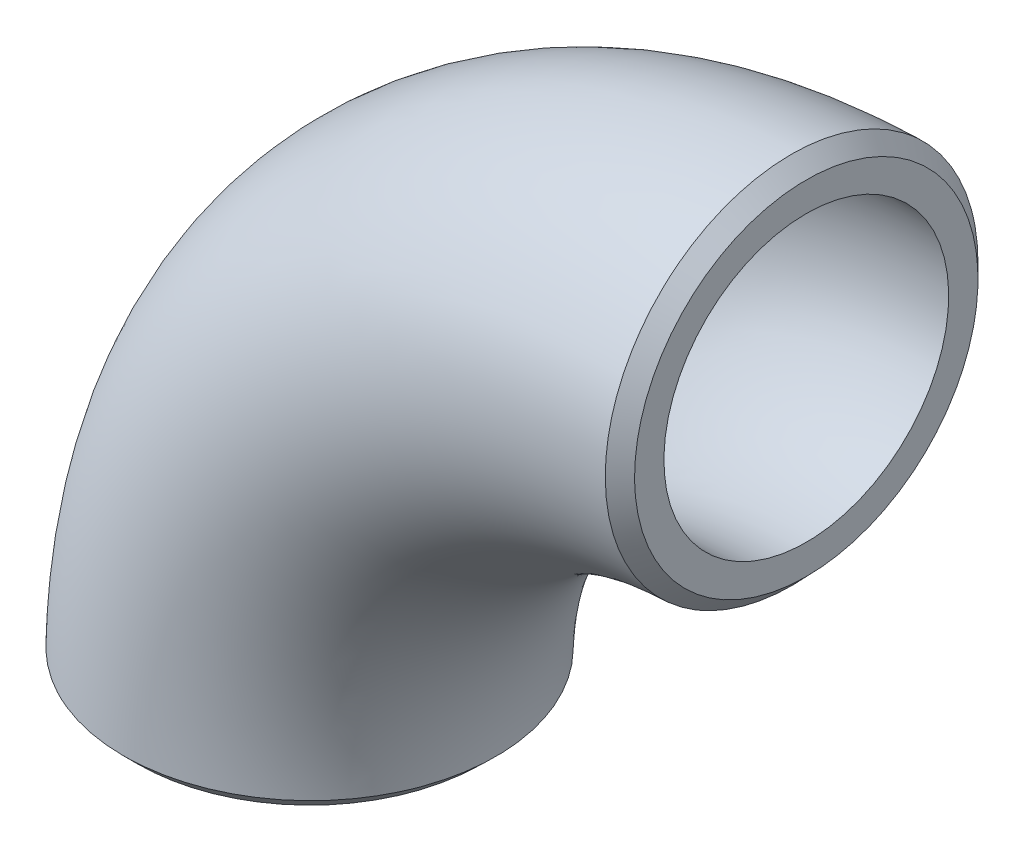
ISO-10303-21;
HEADER;
FILE_DESCRIPTION(('STEP AP214'),'2;1');
FILE_NAME('part.step','',(''),(''),'','','');
FILE_SCHEMA(('AUTOMOTIVE_DESIGN { 1 0 10303 214 1 1 1 1 }'));
ENDSEC;
DATA;
#1=APPLICATION_CONTEXT('core data for automotive mechanical design processes');
#2=APPLICATION_PROTOCOL_DEFINITION('international standard','automotive_design',2000,#1);
#3=PRODUCT_CONTEXT('',#1,'mechanical');
#4=PRODUCT('Part','Part','',(#3));
#5=PRODUCT_RELATED_PRODUCT_CATEGORY('part','',(#4));
#6=PRODUCT_DEFINITION_FORMATION('','',#4);
#7=PRODUCT_DEFINITION_CONTEXT('part definition',#1,'design');
#8=PRODUCT_DEFINITION('design','',#6,#7);
#9=PRODUCT_DEFINITION_SHAPE('','',#8);
#10=(LENGTH_UNIT() NAMED_UNIT(*) SI_UNIT(.MILLI.,.METRE.));
#11=(NAMED_UNIT(*) PLANE_ANGLE_UNIT() SI_UNIT($,.RADIAN.));
#12=(NAMED_UNIT(*) SI_UNIT($,.STERADIAN.) SOLID_ANGLE_UNIT());
#13=UNCERTAINTY_MEASURE_WITH_UNIT(LENGTH_MEASURE(1.E-05),#10,'distance_accuracy_value','');
#14=(GEOMETRIC_REPRESENTATION_CONTEXT(3) GLOBAL_UNCERTAINTY_ASSIGNED_CONTEXT((#13)) GLOBAL_UNIT_ASSIGNED_CONTEXT((#10,
#11,#12)) REPRESENTATION_CONTEXT('',''));
#15=CARTESIAN_POINT('',(0.,0.,0.));
#16=DIRECTION('',(0.,0.,1.));
#17=DIRECTION('',(1.,0.,0.));
#18=AXIS2_PLACEMENT_3D('',#15,#16,#17);
#19=CARTESIAN_POINT('',(0.,0.,0.));
#20=DIRECTION('',(0.,0.,1.));
#21=DIRECTION('',(1.,0.,0.));
#22=AXIS2_PLACEMENT_3D('',#19,#20,#21);
#23=TOROIDAL_SURFACE('',#22,152.4,57.15);
#24=CARTESIAN_POINT('',(-4.49596692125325,152.405658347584,57.1499546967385));
#25=CARTESIAN_POINT('',(-4.48734031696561,148.682436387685,57.1563973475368));
#26=CARTESIAN_POINT('',(-4.47793404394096,144.884678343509,56.7870935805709));
#27=CARTESIAN_POINT('',(-4.45841558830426,137.564344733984,55.3343659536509));
#28=CARTESIAN_POINT('',(-4.44823150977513,134.00319923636,54.2621882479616));
#29=CARTESIAN_POINT('',(-4.42687302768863,127.06048273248,51.4014002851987));
#30=CARTESIAN_POINT('',(-4.41579027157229,123.716987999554,49.6171905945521));
#31=CARTESIAN_POINT('',(-4.39382490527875,117.529672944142,45.4926175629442));
#32=CARTESIAN_POINT('',(-4.3827689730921,114.6308765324,43.1298287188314));
#33=CARTESIAN_POINT('',(-4.36106409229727,109.282197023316,37.798374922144));
#34=CARTESIAN_POINT('',(-4.35075227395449,106.912703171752,34.9103811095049));
#35=CARTESIAN_POINT('',(-4.33184726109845,102.767748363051,28.7364051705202));
#36=CARTESIAN_POINT('',(-4.32314220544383,100.970494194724,25.3930253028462));
#37=CARTESIAN_POINT('',(-4.30874172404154,98.0918719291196,18.4654630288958));
#38=CARTESIAN_POINT('',(-4.30306372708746,97.0085226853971,14.9078734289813));
#39=CARTESIAN_POINT('',(-4.29524502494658,95.5344094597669,7.58403382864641));
#40=CARTESIAN_POINT('',(-4.29317738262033,95.155895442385,3.7890265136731));
#41=CARTESIAN_POINT('',(-4.29314848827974,95.1505820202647,-3.6540683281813));
#42=CARTESIAN_POINT('',(-4.29508308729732,95.5044646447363,-7.36083377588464));
#43=CARTESIAN_POINT('',(-4.30283149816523,96.9641676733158,-14.7579405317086));
#44=CARTESIAN_POINT('',(-4.30856073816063,98.0568079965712,-18.358416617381));
#45=CARTESIAN_POINT('',(-4.32276824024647,100.894648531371,-25.2323907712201));
#46=CARTESIAN_POINT('',(-4.33134351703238,102.660959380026,-28.5561097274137));
#47=CARTESIAN_POINT('',(-4.3504522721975,106.843425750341,-34.827431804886));
#48=CARTESIAN_POINT('',(-4.36073300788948,109.206656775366,-37.7042062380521));
#49=CARTESIAN_POINT('',(-4.38209751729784,114.459594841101,-42.9772182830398));
#50=CARTESIAN_POINT('',(-4.39336495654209,117.404040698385,-45.4010652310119));
#51=CARTESIAN_POINT('',(-4.41543003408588,123.611738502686,-49.5545334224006));
#52=CARTESIAN_POINT('',(-4.42631065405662,126.887852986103,-51.3140778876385));
#53=CARTESIAN_POINT('',(-4.44767463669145,133.812532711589,-54.1989932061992));
#54=CARTESIAN_POINT('',(-4.45808155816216,137.443501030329,-55.30411760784));
#55=CARTESIAN_POINT('',(-4.47754594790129,144.734852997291,-56.7634091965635));
#56=CARTESIAN_POINT('',(-4.48680385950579,148.461144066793,-57.1400962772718));
#57=CARTESIAN_POINT('',(-4.51304767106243,159.757958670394,-57.1695075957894));
#58=CARTESIAN_POINT('',(-4.52811347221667,167.298501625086,-55.6546921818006));
#59=CARTESIAN_POINT('',(-4.54676958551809,177.604529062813,-51.3982905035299));
#60=CARTESIAN_POINT('',(-4.55246411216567,180.939240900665,-49.6243091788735));
#61=CARTESIAN_POINT('',(-4.56268878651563,187.199582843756,-45.4460742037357));
#62=CARTESIAN_POINT('',(-4.56714644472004,190.07476049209,-43.0845275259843));
#63=CARTESIAN_POINT('',(-4.57505954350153,195.35240592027,-37.8244134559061));
#64=CARTESIAN_POINT('',(-4.57854017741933,197.77683983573,-34.8761872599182));
#65=CARTESIAN_POINT('',(-4.58434291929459,201.921244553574,-28.6761643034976));
#66=CARTESIAN_POINT('',(-4.58672598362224,203.681247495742,-25.3991559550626));
#67=CARTESIAN_POINT('',(-4.59057494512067,206.567607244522,-18.4571192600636));
#68=CARTESIAN_POINT('',(-4.59200352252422,207.665844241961,-14.8367523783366));
#69=CARTESIAN_POINT('',(-4.59388645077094,209.120472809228,-7.54348632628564));
#70=CARTESIAN_POINT('',(-4.59436662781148,209.496900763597,-3.81698569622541));
#71=CARTESIAN_POINT('',(-4.59437357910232,209.502325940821,3.73429046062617));
#72=CARTESIAN_POINT('',(-4.59390198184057,209.13262291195,7.4473863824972));
#73=CARTESIAN_POINT('',(-4.59203670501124,207.691330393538,14.7435659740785));
#74=CARTESIAN_POINT('',(-4.59060748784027,206.592432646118,18.3830089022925));
#75=CARTESIAN_POINT('',(-4.58678560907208,203.725550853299,25.3065553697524));
#76=CARTESIAN_POINT('',(-4.58441530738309,201.973919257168,28.5868568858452));
#77=CARTESIAN_POINT('',(-4.57861311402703,197.827966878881,34.8100846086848));
#78=CARTESIAN_POINT('',(-4.5751455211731,195.411486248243,37.7565108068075));
#79=CARTESIAN_POINT('',(-4.56726256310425,190.150534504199,43.0176732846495));
#80=CARTESIAN_POINT('',(-4.56281091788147,187.276558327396,45.3880884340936));
#81=CARTESIAN_POINT('',(-4.55257910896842,181.007493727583,49.5852323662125));
#82=CARTESIAN_POINT('',(-4.54692505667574,177.693133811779,51.3538234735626));
#83=CARTESIAN_POINT('',(-4.53450194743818,170.824958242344,54.2059267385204));
#84=CARTESIAN_POINT('',(-4.52763773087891,167.219819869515,55.3072360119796));
#85=CARTESIAN_POINT('',(-4.51260300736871,159.832831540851,56.7808290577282));
#86=CARTESIAN_POINT('',(-4.50459352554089,156.128880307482,57.1435120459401));
#87=CARTESIAN_POINT('',(-4.49596692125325,152.405658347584,57.1499546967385));
#88=B_SPLINE_CURVE_WITH_KNOTS('',3,(#24,#25,#26,#27,#28,#29,#30,#31,#32,#33,#34,#35,#36,#37,#38,
#39,#40,#41,#42,#43,#44,#45,#46,#47,#48,#49,#50,#51,#52,#53,#54,#55,#56,#57,#58,#59,#60,#61,#62,
#63,#64,#65,#66,#67,#68,#69,#70,#71,#72,#73,#74,#75,#76,#77,#78,#79,#80,#81,#82,#83,#84,#85,#86,
#87),.UNSPECIFIED.,.T.,.F.,(4,2,2,2,2,2,2,2,2,2,2,2,2,2,2,2,2,2,2,2,2,2,2,2,2,2,2,2,2,2,2,4),
(-0.323639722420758,-0.313349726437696,-0.303059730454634,-0.292769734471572,-0.28247973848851,
-0.272189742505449,-0.261899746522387,-0.251609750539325,-0.241319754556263,-0.231029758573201,
-0.220739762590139,-0.210449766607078,-0.200159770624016,-0.189869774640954,-0.179579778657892,
-0.16928978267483,-0.158999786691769,-0.138419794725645,-0.128129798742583,-0.117839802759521,
-0.107549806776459,-0.0972598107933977,-0.0869698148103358,-0.076679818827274,
-0.0663898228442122,-0.0560998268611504,-0.0458098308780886,-0.0355198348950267,
-0.0252298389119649,-0.0149398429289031,-0.00464984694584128,0.00564014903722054),.UNSPECIFIED.);
#89=CARTESIAN_POINT('',(-4.49596692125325,152.405658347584,57.1499546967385));
#90=VERTEX_POINT('',#89);
#91=EDGE_CURVE('E46',#90,#90,#88,.F.);
#92=ORIENTED_EDGE('',*,*,#91,.T.);
#93=EDGE_LOOP('',(#92));
#94=FACE_BOUND('',#93,.T.);
#95=CARTESIAN_POINT('',(-152.405658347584,4.49596692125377,57.1499546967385));
#96=CARTESIAN_POINT('',(-153.340796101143,4.4981347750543,57.1490780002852));
#97=CARTESIAN_POINT('',(-154.275861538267,4.50026492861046,57.1247714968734));
#98=CARTESIAN_POINT('',(-156.148390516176,4.50446084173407,57.0299787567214));
#99=CARTESIAN_POINT('',(-157.085842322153,4.50652622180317,56.9592599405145));
#100=CARTESIAN_POINT('',(-158.956444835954,4.51058224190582,56.7723241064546));
#101=CARTESIAN_POINT('',(-159.889594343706,4.51257286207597,56.656095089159));
#102=CARTESIAN_POINT('',(-161.744820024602,4.51646785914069,56.3781300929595));
#103=CARTESIAN_POINT('',(-162.666927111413,4.51837258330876,56.2166009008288));
#104=CARTESIAN_POINT('',(-164.497283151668,4.52209513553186,55.8491423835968));
#105=CARTESIAN_POINT('',(-165.405579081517,4.52391336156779,55.6434466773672));
#106=CARTESIAN_POINT('',(-167.21038462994,4.52747349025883,55.1885893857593));
#107=CARTESIAN_POINT('',(-168.106903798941,4.52921545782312,54.9394657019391));
#108=CARTESIAN_POINT('',(-169.888356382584,4.53262700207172,54.3969877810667));
#109=CARTESIAN_POINT('',(-170.773264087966,4.53429643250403,54.1035490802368));
#110=CARTESIAN_POINT('',(-172.531892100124,4.53756801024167,53.4723662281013));
#111=CARTESIAN_POINT('',(-173.405539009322,4.5391697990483,53.1344176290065));
#112=CARTESIAN_POINT('',(-175.13819600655,4.54230358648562,52.4146832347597));
#113=CARTESIAN_POINT('',(-175.99714382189,4.54383531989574,52.0327474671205));
#114=CARTESIAN_POINT('',(-177.694441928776,4.54682243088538,51.2272232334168));
#115=CARTESIAN_POINT('',(-178.532807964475,4.54827786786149,50.8036679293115));
#116=CARTESIAN_POINT('',(-180.18563733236,4.55111131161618,49.9172238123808));
#117=CARTESIAN_POINT('',(-181.000157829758,4.55248951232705,49.4544415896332));
#118=CARTESIAN_POINT('',(-182.6017549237,4.5551667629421,48.4914439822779));
#119=CARTESIAN_POINT('',(-183.388939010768,4.55646614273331,47.9914074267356));
#120=CARTESIAN_POINT('',(-184.936188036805,4.55899091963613,46.9544030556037));
#121=CARTESIAN_POINT('',(-185.696306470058,4.56021646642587,46.4175150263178));
#122=CARTESIAN_POINT('',(-187.191439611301,4.56260094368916,45.3061290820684));
#123=CARTESIAN_POINT('',(-187.926387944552,4.56375970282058,44.7315418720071));
#124=CARTESIAN_POINT('',(-189.369978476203,4.5660120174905,43.5447737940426));
#125=CARTESIAN_POINT('',(-190.078509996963,4.56710530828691,42.932458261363));
#126=CARTESIAN_POINT('',(-191.468191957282,4.56922836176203,41.6704352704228));
#127=CARTESIAN_POINT('',(-192.149180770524,4.57025776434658,41.0205498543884));
#128=CARTESIAN_POINT('',(-193.477878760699,4.57224774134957,39.6884815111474));
#129=CARTESIAN_POINT('',(-194.125610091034,4.57320836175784,39.0063206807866));
#130=CARTESIAN_POINT('',(-195.382788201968,4.5750564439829,37.6149871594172));
#131=CARTESIAN_POINT('',(-195.992440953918,4.57594430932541,36.9060006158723));
#132=CARTESIAN_POINT('',(-197.173834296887,4.57765055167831,35.4615953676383));
#133=CARTESIAN_POINT('',(-197.745709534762,4.57846917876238,34.7262867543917));
#134=CARTESIAN_POINT('',(-198.852280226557,4.58004129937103,33.2300541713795));
#135=CARTESIAN_POINT('',(-199.387034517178,4.58079489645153,32.4691737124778));
#136=CARTESIAN_POINT('',(-200.420497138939,4.58224142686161,30.9193003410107));
#137=CARTESIAN_POINT('',(-200.919067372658,4.5829341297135,30.1302152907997));
#138=CARTESIAN_POINT('',(-201.87924933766,4.58425956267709,28.5242311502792));
#139=CARTESIAN_POINT('',(-202.340652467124,4.58489195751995,27.7072074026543));
#140=CARTESIAN_POINT('',(-203.223982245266,4.58609554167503,26.050073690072));
#141=CARTESIAN_POINT('',(-203.645831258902,4.58666661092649,25.2099223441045));
#142=CARTESIAN_POINT('',(-204.446879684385,4.58774526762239,23.5109226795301));
#143=CARTESIAN_POINT('',(-204.826136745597,4.58825294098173,22.6521015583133));
#144=CARTESIAN_POINT('',(-205.540130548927,4.58920451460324,20.9205787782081));
#145=CARTESIAN_POINT('',(-205.875055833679,4.58964868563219,20.0479548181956));
#146=CARTESIAN_POINT('',(-206.500873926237,4.59047533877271,18.2904259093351));
#147=CARTESIAN_POINT('',(-206.791913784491,4.5908580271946,17.4055733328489));
#148=CARTESIAN_POINT('',(-207.329970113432,4.59156297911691,15.6231750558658));
#149=CARTESIAN_POINT('',(-207.5770133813,4.59188527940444,14.725637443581));
#150=CARTESIAN_POINT('',(-208.027818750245,4.59247172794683,12.917656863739));
#151=CARTESIAN_POINT('',(-208.231484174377,4.59273574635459,12.0071897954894));
#152=CARTESIAN_POINT('',(-208.594643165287,4.593205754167,10.1727794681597));
#153=CARTESIAN_POINT('',(-208.75391249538,4.59341144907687,9.2487917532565));
#154=CARTESIAN_POINT('',(-209.026993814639,4.59376357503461,7.39124643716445));
#155=CARTESIAN_POINT('',(-209.140665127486,4.59390982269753,6.45766819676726));
#156=CARTESIAN_POINT('',(-209.322324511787,4.59414319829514,4.58719166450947));
#157=CARTESIAN_POINT('',(-209.390366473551,4.5942303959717,3.65029860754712));
#158=CARTESIAN_POINT('',(-209.479633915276,4.59434464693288,1.77937858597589));
#159=CARTESIAN_POINT('',(-209.501111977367,4.59437202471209,0.845363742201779));
#160=CARTESIAN_POINT('',(-209.498014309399,4.59436805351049,-1.01832431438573));
#161=CARTESIAN_POINT('',(-209.473647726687,4.59433697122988,-1.9479979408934));
#162=CARTESIAN_POINT('',(-209.380012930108,4.59421711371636,-3.80586914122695));
#163=CARTESIAN_POINT('',(-209.310706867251,4.59412828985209,-4.73406480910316));
#164=CARTESIAN_POINT('',(-209.126277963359,4.59389132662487,-6.5891075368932));
#165=CARTESIAN_POINT('',(-209.010999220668,4.59374298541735,-7.51593912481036));
#166=CARTESIAN_POINT('',(-208.734279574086,4.59338611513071,-9.36841350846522));
#167=CARTESIAN_POINT('',(-208.572563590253,4.59317722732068,-10.2940151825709));
#168=CARTESIAN_POINT('',(-208.203444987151,4.59269940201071,-12.1377787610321));
#169=CARTESIAN_POINT('',(-207.995961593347,4.59243035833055,-13.0559244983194));
#170=CARTESIAN_POINT('',(-207.536733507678,4.59183273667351,-14.8772519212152));
#171=CARTESIAN_POINT('',(-207.285165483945,4.59150439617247,-15.780478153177));
#172=CARTESIAN_POINT('',(-206.738909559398,4.59078840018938,-17.5703080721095));
#173=CARTESIAN_POINT('',(-206.444376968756,4.59040095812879,-18.4569591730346));
#174=CARTESIAN_POINT('',(-205.813315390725,4.58956693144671,-20.2119928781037));
#175=CARTESIAN_POINT('',(-205.476923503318,4.58912053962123,-21.0804247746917));
#176=CARTESIAN_POINT('',(-204.761771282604,4.58816684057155,-22.8002896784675));
#177=CARTESIAN_POINT('',(-204.382985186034,4.58765949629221,-23.6517119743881));
#178=CARTESIAN_POINT('',(-203.582690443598,4.58658127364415,-25.3382021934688));
#179=CARTESIAN_POINT('',(-203.161024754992,4.58601016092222,-26.1731955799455));
#180=CARTESIAN_POINT('',(-202.275950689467,4.58480347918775,-27.8241931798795));
#181=CARTESIAN_POINT('',(-201.81241337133,4.58416771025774,-28.640128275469));
#182=CARTESIAN_POINT('',(-200.844390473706,4.58283056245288,-30.2502648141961));
#183=CARTESIAN_POINT('',(-200.339800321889,4.58212901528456,-31.0444033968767));
#184=CARTESIAN_POINT('',(-199.293408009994,4.58066321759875,-32.6048007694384));
#185=CARTESIAN_POINT('',(-198.751705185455,4.57989913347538,-33.3711261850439));
#186=CARTESIAN_POINT('',(-197.634377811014,4.57830997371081,-34.8719628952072));
#187=CARTESIAN_POINT('',(-197.058960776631,4.57748526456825,-35.6066286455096));
#188=CARTESIAN_POINT('',(-195.874354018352,4.57577228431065,-37.0446615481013));
#189=CARTESIAN_POINT('',(-195.265265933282,4.57488420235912,-37.7481124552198));
#190=CARTESIAN_POINT('',(-194.013933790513,4.57304281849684,-39.1246755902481));
#191=CARTESIAN_POINT('',(-193.371694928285,4.57208952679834,-39.7977925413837));
#192=CARTESIAN_POINT('',(-192.051635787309,4.57011071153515,-41.1149756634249));
#193=CARTESIAN_POINT('',(-191.373653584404,4.56908485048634,-41.7588796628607));
#194=CARTESIAN_POINT('',(-189.983081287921,4.56695837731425,-43.0157170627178));
#195=CARTESIAN_POINT('',(-189.270327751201,4.56585740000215,-43.628469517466));
#196=CARTESIAN_POINT('',(-187.815489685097,4.5635853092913,-44.8189674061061));
#197=CARTESIAN_POINT('',(-187.073388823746,4.56241415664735,-45.3966928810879));
#198=CARTESIAN_POINT('',(-185.564527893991,4.56000486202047,-46.5123318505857));
#199=CARTESIAN_POINT('',(-184.79788144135,4.55876701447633,-47.0503989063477));
#200=CARTESIAN_POINT('',(-183.24294910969,4.55622578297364,-48.0852972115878));
#201=CARTESIAN_POINT('',(-182.454794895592,4.55492276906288,-48.5823264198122));
#202=CARTESIAN_POINT('',(-180.856382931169,4.55224696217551,-49.5370403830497));
#203=CARTESIAN_POINT('',(-180.046154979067,4.55087426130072,-49.9947750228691));
#204=CARTESIAN_POINT('',(-178.402963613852,4.54805341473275,-50.870574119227));
#205=CARTESIAN_POINT('',(-177.569967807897,4.54660515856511,-51.2885778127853));
#206=CARTESIAN_POINT('',(-175.880960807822,4.5436287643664,-52.0852356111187));
#207=CARTESIAN_POINT('',(-175.024865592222,4.54210030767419,-52.463711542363));
#208=CARTESIAN_POINT('',(-173.291758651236,4.53896207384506,-53.1794539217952));
#209=CARTESIAN_POINT('',(-172.414679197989,4.53735200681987,-53.5165564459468));
#210=CARTESIAN_POINT('',(-170.644984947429,4.53405535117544,-54.1470056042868));
#211=CARTESIAN_POINT('',(-169.752370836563,4.53236876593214,-54.4403541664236));
#212=CARTESIAN_POINT('',(-167.956041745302,4.52892362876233,-54.9824328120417));
#213=CARTESIAN_POINT('',(-167.052358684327,4.52716525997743,-55.2312686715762));
#214=CARTESIAN_POINT('',(-165.238183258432,4.52358021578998,-55.6829533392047));
#215=CARTESIAN_POINT('',(-164.327744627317,4.52175391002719,-55.8860177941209));
#216=CARTESIAN_POINT('',(-162.500233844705,4.51802926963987,-56.2466534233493));
#217=CARTESIAN_POINT('',(-161.583183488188,4.51613112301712,-56.4043351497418));
#218=CARTESIAN_POINT('',(-159.740382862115,4.51225530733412,-56.6753703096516));
#219=CARTESIAN_POINT('',(-158.814617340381,4.51027746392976,-56.7886200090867));
#220=CARTESIAN_POINT('',(-156.95535217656,4.50623950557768,-56.9700447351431));
#221=CARTESIAN_POINT('',(-156.021836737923,4.50417912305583,-57.0380580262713));
#222=CARTESIAN_POINT('',(-154.148082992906,4.4999740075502,-57.1285424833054));
#223=CARTESIAN_POINT('',(-153.20783399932,4.49782891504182,-57.1507919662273));
#224=CARTESIAN_POINT('',(-151.326525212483,4.49346245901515,-57.1491309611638));
#225=CARTESIAN_POINT('',(-150.385465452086,4.49124102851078,-57.125178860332));
#226=CARTESIAN_POINT('',(-148.507753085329,4.48672962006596,-57.0307047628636));
#227=CARTESIAN_POINT('',(-147.571095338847,4.48443980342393,-56.9602851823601));
#228=CARTESIAN_POINT('',(-145.702113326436,4.47978899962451,-56.7730429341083));
#229=CARTESIAN_POINT('',(-144.769790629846,4.47742798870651,-56.6562046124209));
#230=CARTESIAN_POINT('',(-142.909376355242,4.47263214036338,-56.3763660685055));
#231=CARTESIAN_POINT('',(-141.981304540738,4.47019711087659,-56.2132346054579));
#232=CARTESIAN_POINT('',(-140.135081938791,4.46526489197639,-55.8418492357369));
#233=CARTESIAN_POINT('',(-139.216923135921,4.46276775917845,-55.6336351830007));
#234=CARTESIAN_POINT('',(-137.396815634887,4.45772680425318,-55.1732533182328));
#235=CARTESIAN_POINT('',(-136.494807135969,4.45518329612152,-54.9213220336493));
#236=CARTESIAN_POINT('',(-134.707653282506,4.45005218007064,-54.3744197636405));
#237=CARTESIAN_POINT('',(-133.822457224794,4.44746477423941,-54.0796143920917));
#238=CARTESIAN_POINT('',(-132.069522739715,4.44224845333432,-53.4479514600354));
#239=CARTESIAN_POINT('',(-131.201748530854,4.43961964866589,-53.1111931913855));
#240=CARTESIAN_POINT('',(-129.482101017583,4.43431463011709,-52.3949919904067));
#241=CARTESIAN_POINT('',(-128.630260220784,4.43163833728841,-52.0154709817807));
#242=CARTESIAN_POINT('',(-126.942713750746,4.42624062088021,-51.2135087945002));
#243=CARTESIAN_POINT('',(-126.107089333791,4.42351905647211,-50.7908966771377));
#244=CARTESIAN_POINT('',(-124.455243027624,4.4180437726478,-49.9042192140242));
#245=CARTESIAN_POINT('',(-123.639079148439,4.41528998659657,-49.4400457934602));
#246=CARTESIAN_POINT('',(-122.029613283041,4.40976289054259,-48.4713721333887));
#247=CARTESIAN_POINT('',(-121.236341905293,4.40698956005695,-47.9668210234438));
#248=CARTESIAN_POINT('',(-119.678175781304,4.40144526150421,-46.9208874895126));
#249=CARTESIAN_POINT('',(-118.913197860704,4.3986743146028,-46.3796289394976));
#250=CARTESIAN_POINT('',(-117.414428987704,4.39315272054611,-45.2630270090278));
#251=CARTESIAN_POINT('',(-116.680502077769,4.39040204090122,-44.6878661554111));
#252=CARTESIAN_POINT('',(-115.243377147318,4.38492620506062,-43.5034240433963));
#253=CARTESIAN_POINT('',(-114.540116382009,4.38220100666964,-42.8942188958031));
#254=CARTESIAN_POINT('',(-113.163389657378,4.37678070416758,-41.6421686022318));
#255=CARTESIAN_POINT('',(-112.48994296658,4.37408562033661,-40.9993022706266));
#256=CARTESIAN_POINT('',(-111.172027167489,4.3687274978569,-39.6778290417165));
#257=CARTESIAN_POINT('',(-110.52772652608,4.36606469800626,-38.999054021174));
#258=CARTESIAN_POINT('',(-109.2704793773,4.36078995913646,-37.6072423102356));
#259=CARTESIAN_POINT('',(-108.657695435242,4.35817831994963,-36.8940588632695));
#260=CARTESIAN_POINT('',(-107.467532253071,4.35303396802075,-35.4388256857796));
#261=CARTESIAN_POINT('',(-106.890150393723,4.35050124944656,-34.6967780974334));
#262=CARTESIAN_POINT('',(-105.775630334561,4.34554454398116,-33.1885958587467));
#263=CARTESIAN_POINT('',(-105.238310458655,4.34312008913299,-32.4225955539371));
#264=CARTESIAN_POINT('',(-104.204824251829,4.33839581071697,-30.8689975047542));
#265=CARTESIAN_POINT('',(-103.70846101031,4.3360954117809,-30.0815306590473));
#266=CARTESIAN_POINT('',(-102.754564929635,4.33162279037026,-28.4838693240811));
#267=CARTESIAN_POINT('',(-102.297015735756,4.32945051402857,-27.6736846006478));
#268=CARTESIAN_POINT('',(-101.421223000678,4.32524663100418,-26.029871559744));
#269=CARTESIAN_POINT('',(-101.003075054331,4.32321536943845,-25.1961922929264));
#270=CARTESIAN_POINT('',(-100.205958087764,4.31930371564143,-23.5050131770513));
#271=CARTESIAN_POINT('',(-99.8272040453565,4.31742416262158,-22.6474120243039));
#272=CARTESIAN_POINT('',(-99.1112515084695,4.31383972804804,-20.9118913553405));
#273=CARTESIAN_POINT('',(-98.7741866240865,4.31213541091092,-20.0339167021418));
#274=CARTESIAN_POINT('',(-98.1443998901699,4.30892590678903,-18.2638087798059));
#275=CARTESIAN_POINT('',(-97.8516072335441,4.30742040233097,-17.3717006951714));
#276=CARTESIAN_POINT('',(-97.3108813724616,4.30462043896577,-15.5767987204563));
#277=CARTESIAN_POINT('',(-97.0628211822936,4.30332538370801,-14.6740430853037));
#278=CARTESIAN_POINT('',(-96.6124304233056,4.3009602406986,-12.861216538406));
#279=CARTESIAN_POINT('',(-96.4099121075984,4.29988923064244,-11.9511922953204));
#280=CARTESIAN_POINT('',(-96.0500522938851,4.29797935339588,-10.1236252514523));
#281=CARTESIAN_POINT('',(-95.8926459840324,4.29714015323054,-9.20609520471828));
#282=CARTESIAN_POINT('',(-95.6222783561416,4.29569431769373,-7.36189095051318));
#283=CARTESIAN_POINT('',(-95.509442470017,4.29508833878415,-6.43519835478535));
#284=CARTESIAN_POINT('',(-95.3290153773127,4.29411656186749,-4.57394149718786));
#285=CARTESIAN_POINT('',(-95.2615936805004,4.29375166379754,-3.63936078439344));
#286=CARTESIAN_POINT('',(-95.1726722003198,4.29326926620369,-1.76362911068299));
#287=CARTESIAN_POINT('',(-95.1513890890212,4.2931529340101,-0.822467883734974));
#288=CARTESIAN_POINT('',(-95.1552528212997,4.29317382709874,1.05862998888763));
#289=CARTESIAN_POINT('',(-95.1803440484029,4.29331074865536,1.99856675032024));
#290=CARTESIAN_POINT('',(-95.2766722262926,4.29383301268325,3.87033223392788));
#291=CARTESIAN_POINT('',(-95.3476269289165,4.294216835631,4.80217545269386));
#292=CARTESIAN_POINT('',(-95.5350535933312,4.2952258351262,6.65781402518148));
#293=CARTESIAN_POINT('',(-95.6513577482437,4.29585012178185,7.58162635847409));
#294=CARTESIAN_POINT('',(-95.9283647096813,4.29733072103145,9.42136005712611));
#295=CARTESIAN_POINT('',(-96.0890105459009,4.29818673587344,10.337290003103));
#296=CARTESIAN_POINT('',(-96.4557919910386,4.30013193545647,12.163929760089));
#297=CARTESIAN_POINT('',(-96.662112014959,4.30122206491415,13.074602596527));
#298=CARTESIAN_POINT('',(-97.1206575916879,4.30362752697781,14.8895533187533));
#299=CARTESIAN_POINT('',(-97.3731257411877,4.30494404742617,15.7937698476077));
#300=CARTESIAN_POINT('',(-97.9222041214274,4.30778385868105,17.5902766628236));
#301=CARTESIAN_POINT('',(-98.2188841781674,4.30930747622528,18.482545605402));
#302=CARTESIAN_POINT('',(-98.8554063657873,4.3125468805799,20.2493746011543));
#303=CARTESIAN_POINT('',(-99.1951532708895,4.31426224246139,21.1239689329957));
#304=CARTESIAN_POINT('',(-99.9158082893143,4.31786466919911,22.8512043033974));
#305=CARTESIAN_POINT('',(-100.296515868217,4.31975089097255,23.7039290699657));
#306=CARTESIAN_POINT('',(-101.097824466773,4.32367690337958,25.3874020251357));
#307=CARTESIAN_POINT('',(-101.518306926,4.32571623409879,26.2182066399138));
#308=CARTESIAN_POINT('',(-102.399561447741,4.32993921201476,27.8580831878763));
#309=CARTESIAN_POINT('',(-102.860330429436,4.33212284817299,28.6671567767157));
#310=CARTESIAN_POINT('',(-103.821886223,4.33662277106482,30.2641892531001));
#311=CARTESIAN_POINT('',(-104.32277942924,4.3389394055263,31.0520840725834));
#312=CARTESIAN_POINT('',(-105.365224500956,4.34369457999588,32.6059595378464));
#313=CARTESIAN_POINT('',(-105.906958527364,4.34613364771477,33.3718180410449));
#314=CARTESIAN_POINT('',(-107.028922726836,4.3511122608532,34.8775950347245));
#315=CARTESIAN_POINT('',(-107.609240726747,4.3536520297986,35.6174480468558));
#316=CARTESIAN_POINT('',(-108.804304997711,4.35880535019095,37.066921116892));
#317=CARTESIAN_POINT('',(-109.418997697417,4.36141878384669,37.7765853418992));
#318=CARTESIAN_POINT('',(-110.67938105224,4.3666937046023,39.1608319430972));
#319=CARTESIAN_POINT('',(-111.324885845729,4.36935485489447,39.8355834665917));
#320=CARTESIAN_POINT('',(-112.645514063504,4.37471077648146,41.1497221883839));
#321=CARTESIAN_POINT('',(-113.320501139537,4.37740535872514,41.7892464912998));
#322=CARTESIAN_POINT('',(-114.701365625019,4.38282850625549,43.0357007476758));
#323=CARTESIAN_POINT('',(-115.407278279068,4.38555710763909,43.6425916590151));
#324=CARTESIAN_POINT('',(-116.850640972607,4.39104272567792,44.8231468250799));
#325=CARTESIAN_POINT('',(-117.588195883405,4.3937998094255,45.3966829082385));
#326=CARTESIAN_POINT('',(-119.095143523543,4.39933643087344,46.510281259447));
#327=CARTESIAN_POINT('',(-119.864703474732,4.40211600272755,47.0501171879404));
#328=CARTESIAN_POINT('',(-121.430488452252,4.40767139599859,48.0920025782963));
#329=CARTESIAN_POINT('',(-122.226747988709,4.41044720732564,48.5940001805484));
#330=CARTESIAN_POINT('',(-123.839482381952,4.41596954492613,49.5558729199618));
#331=CARTESIAN_POINT('',(-124.655850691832,4.41871614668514,50.0159266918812));
#332=CARTESIAN_POINT('',(-126.307178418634,4.42417361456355,50.8937619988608));
#333=CARTESIAN_POINT('',(-127.142059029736,4.42688457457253,51.311691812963));
#334=CARTESIAN_POINT('',(-128.828768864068,4.43226427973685,52.1052135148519));
#335=CARTESIAN_POINT('',(-129.680542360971,4.43493312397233,52.4809238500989));
#336=CARTESIAN_POINT('',(-131.402496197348,4.44023096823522,53.1906433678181));
#337=CARTESIAN_POINT('',(-132.272697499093,4.44285991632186,53.5246017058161));
#338=CARTESIAN_POINT('',(-134.031985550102,4.44808013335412,54.1507866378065));
#339=CARTESIAN_POINT('',(-134.921134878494,4.45067120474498,54.4428373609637));
#340=CARTESIAN_POINT('',(-136.71531630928,4.45580723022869,54.9839899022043));
#341=CARTESIAN_POINT('',(-137.620388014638,4.45835202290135,55.232960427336));
#342=CARTESIAN_POINT('',(-139.443495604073,4.46338663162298,55.6864294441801));
#343=CARTESIAN_POINT('',(-140.361553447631,4.46587632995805,55.89083968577));
#344=CARTESIAN_POINT('',(-142.203923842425,4.47078360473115,56.253615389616));
#345=CARTESIAN_POINT('',(-143.128210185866,4.47320137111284,56.4121140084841));
#346=CARTESIAN_POINT('',(-144.978523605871,4.47795723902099,56.6827901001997));
#347=CARTESIAN_POINT('',(-145.904515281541,4.48029569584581,56.7952094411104));
#348=CARTESIAN_POINT('',(-147.758542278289,4.48489731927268,56.9741999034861));
#349=CARTESIAN_POINT('',(-148.686566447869,4.4871606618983,57.0408866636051));
#350=CARTESIAN_POINT('',(-150.544960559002,4.49161706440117,57.1291763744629));
#351=CARTESIAN_POINT('',(-151.475330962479,4.49381010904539,57.1507696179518));
#352=CARTESIAN_POINT('',(-152.405658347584,4.49596692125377,57.1499546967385));
#353=B_SPLINE_CURVE_WITH_KNOTS('',3,(#95,#96,#97,#98,#99,#100,#101,#102,#103,#104,#105,#106,
#107,#108,#109,#110,#111,#112,#113,#114,#115,#116,#117,#118,#119,#120,#121,#122,#123,#124,#125,
#126,#127,#128,#129,#130,#131,#132,#133,#134,#135,#136,#137,#138,#139,#140,#141,#142,#143,#144,
#145,#146,#147,#148,#149,#150,#151,#152,#153,#154,#155,#156,#157,#158,#159,#160,#161,#162,#163,
#164,#165,#166,#167,#168,#169,#170,#171,#172,#173,#174,#175,#176,#177,#178,#179,#180,#181,#182,
#183,#184,#185,#186,#187,#188,#189,#190,#191,#192,#193,#194,#195,#196,#197,#198,#199,#200,#201,
#202,#203,#204,#205,#206,#207,#208,#209,#210,#211,#212,#213,#214,#215,#216,#217,#218,#219,#220,
#221,#222,#223,#224,#225,#226,#227,#228,#229,#230,#231,#232,#233,#234,#235,#236,#237,#238,#239,
#240,#241,#242,#243,#244,#245,#246,#247,#248,#249,#250,#251,#252,#253,#254,#255,#256,#257,#258,
#259,#260,#261,#262,#263,#264,#265,#266,#267,#268,#269,#270,#271,#272,#273,#274,#275,#276,#277,
#278,#279,#280,#281,#282,#283,#284,#285,#286,#287,#288,#289,#290,#291,#292,#293,#294,#295,#296,
#297,#298,#299,#300,#301,#302,#303,#304,#305,#306,#307,#308,#309,#310,#311,#312,#313,#314,#315,
#316,#317,#318,#319,#320,#321,#322,#323,#324,#325,#326,#327,#328,#329,#330,#331,#332,#333,#334,
#335,#336,#337,#338,#339,#340,#341,#342,#343,#344,#345,#346,#347,#348,#349,#350,#351,#352),
.UNSPECIFIED.,.F.,.F.,(4,2,2,2,2,2,2,2,2,2,2,2,2,2,2,2,2,2,2,2,2,2,2,2,2,2,2,2,2,2,2,2,2,2,2,2,
2,2,2,2,2,2,2,2,2,2,2,2,2,2,2,2,2,2,2,2,2,2,2,2,2,2,2,2,2,2,2,2,2,2,2,2,2,2,2,2,2,2,2,2,2,2,2,2,
2,2,2,2,2,2,2,2,2,2,2,2,2,2,2,2,2,2,2,2,2,2,2,2,2,2,2,2,2,2,2,2,2,2,2,2,2,2,2,2,2,2,2,2,4),(0.,
2.80505298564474,5.62427098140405,8.44423280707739,11.2515258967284,14.0443203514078,
16.8346895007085,19.6304457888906,22.4395235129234,25.2584792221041,28.0752067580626,
30.8845118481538,33.6811069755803,36.4718274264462,39.2694149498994,42.0776422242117,
44.900479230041,47.7214108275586,50.5254554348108,53.3188965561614,56.1078038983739,
58.906849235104,61.7206444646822,64.5398516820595,67.355195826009,70.1581527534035,
72.9514982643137,75.7431365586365,78.5409329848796,81.3526145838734,84.1729051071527,
86.989858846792,89.7914936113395,92.5803780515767,95.3716144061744,98.172397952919,
100.990127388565,103.812870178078,106.624549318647,109.426305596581,112.219115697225,
115.013632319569,117.818779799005,120.632880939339,123.454389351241,126.268620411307,
129.067051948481,131.85745413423,134.647420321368,137.451343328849,140.270031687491,
143.09031136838,145.899024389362,148.693283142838,151.483940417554,154.278799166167,
157.085756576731,159.903498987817,162.721117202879,165.531948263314,168.329245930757,
171.119670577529,173.916571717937,176.723419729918,179.543832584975,182.366786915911,
185.183540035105,188.001243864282,190.827017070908,193.650302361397,196.458763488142,
199.256650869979,202.048037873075,204.844606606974,207.65273584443,210.468391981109,
213.287653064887,216.097832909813,218.894063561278,221.684275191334,224.4762645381,
227.282739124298,230.102476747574,232.922005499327,235.727853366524,238.519312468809,
241.309589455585,244.106470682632,246.917891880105,249.738101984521,252.553752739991,
255.361280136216,258.157012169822,260.948707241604,263.748203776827,266.558092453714,
269.381148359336,272.200820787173,275.003303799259,277.795513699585,280.58415272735,
283.384263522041,286.199541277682,289.019313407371,291.83295603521,294.633401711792,
297.425748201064,300.217881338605,303.017680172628,305.830804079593,308.650566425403,
311.466050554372,314.266290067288,317.054723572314,319.846422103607,322.648221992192,
325.467168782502,328.289911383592,331.100007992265,333.899839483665,336.691608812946,
339.486745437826,342.293289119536,345.108240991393,347.928718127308,350.740931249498,
353.538188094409,356.328345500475,359.119103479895),.UNSPECIFIED.);
#354=CARTESIAN_POINT('',(-152.405658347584,4.49596692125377,57.1499546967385));
#355=VERTEX_POINT('',#354);
#356=EDGE_CURVE('E51',#355,#355,#353,.F.);
#357=ORIENTED_EDGE('',*,*,#356,.T.);
#358=EDGE_LOOP('',(#357));
#359=FACE_BOUND('',#358,.T.);
#360=ADVANCED_FACE('F34',(#94,#359),#23,.T.);
#361=CARTESIAN_POINT('',(4.98262158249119E-13,152.4,0.));
#362=DIRECTION('',(1.,0.,0.));
#363=DIRECTION('',(0.,0.,1.));
#364=AXIS2_PLACEMENT_3D('',#361,#362,#363);
#365=PLANE('',#364);
#366=CARTESIAN_POINT('',(5.11625189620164E-13,152.4,52.6541582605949));
#367=CARTESIAN_POINT('',(5.14362181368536E-13,153.284557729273,52.6527095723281));
#368=CARTESIAN_POINT('',(5.17194502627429E-13,154.16910408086,52.6292728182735));
#369=CARTESIAN_POINT('',(5.22970890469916E-13,155.93610877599,52.538126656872));
#370=CARTESIAN_POINT('',(5.25914982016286E-13,156.818566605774,52.4704073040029));
#371=CARTESIAN_POINT('',(5.31843948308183E-13,158.581681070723,52.2901184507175));
#372=CARTESIAN_POINT('',(5.34828921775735E-13,159.462323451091,52.1774094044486));
#373=CARTESIAN_POINT('',(5.40772611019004E-13,161.222052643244,51.9068953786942));
#374=CARTESIAN_POINT('',(5.43731062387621E-13,162.101098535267,51.7488243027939));
#375=CARTESIAN_POINT('',(5.49516442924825E-13,163.851363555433,51.3878860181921));
#376=CARTESIAN_POINT('',(5.52343161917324E-13,164.722568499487,51.1849500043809));
#377=CARTESIAN_POINT('',(5.57911191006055E-13,166.451136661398,50.7356032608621));
#378=CARTESIAN_POINT('',(5.60652714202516E-13,167.308531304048,50.4893133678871));
#379=CARTESIAN_POINT('',(5.66093635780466E-13,169.006880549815,49.9545890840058));
#380=CARTESIAN_POINT('',(5.68793145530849E-13,169.847881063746,49.6663005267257));
#381=CARTESIAN_POINT('',(5.74260992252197E-13,171.510959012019,49.0486119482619));
#382=CARTESIAN_POINT('',(5.77029023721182E-13,172.333096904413,48.7193747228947));
#383=CARTESIAN_POINT('',(5.82464857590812E-13,173.960488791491,48.0195439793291));
#384=CARTESIAN_POINT('',(5.85132563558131E-13,174.765726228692,47.6489119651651));
#385=CARTESIAN_POINT('',(5.90387899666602E-13,176.359200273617,46.8662505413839));
#386=CARTESIAN_POINT('',(5.9297522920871E-13,177.147370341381,46.4540856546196));
#387=CARTESIAN_POINT('',(5.98116852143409E-13,178.70481725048,45.5887507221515));
#388=CARTESIAN_POINT('',(6.00670981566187E-13,179.474010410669,45.1354300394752));
#389=CARTESIAN_POINT('',(6.05844018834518E-13,180.990887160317,44.1886171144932));
#390=CARTESIAN_POINT('',(6.08463116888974E-13,181.738489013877,43.6949939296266));
#391=CARTESIAN_POINT('',(6.13482752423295E-13,183.203853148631,42.6729989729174));
#392=CARTESIAN_POINT('',(6.15884342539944E-13,183.921748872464,42.1448185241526));
#393=CARTESIAN_POINT('',(6.20504236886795E-13,185.326111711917,41.0553533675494));
#394=CARTESIAN_POINT('',(6.22723413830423E-13,186.012720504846,40.4942513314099));
#395=CARTESIAN_POINT('',(6.27023782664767E-13,187.355084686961,39.3394111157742));
#396=CARTESIAN_POINT('',(6.29105287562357E-13,188.010909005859,38.7457530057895));
#397=CARTESIAN_POINT('',(6.33185483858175E-13,189.293035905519,37.5258293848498));
#398=CARTESIAN_POINT('',(6.35184071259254E-13,189.91930154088,36.8995250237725));
#399=CARTESIAN_POINT('',(6.39109537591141E-13,191.142858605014,35.6113643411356));
#400=CARTESIAN_POINT('',(6.41035859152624E-13,191.739932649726,34.9493014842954));
#401=CARTESIAN_POINT('',(6.44775549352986E-13,192.901920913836,33.5938210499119));
#402=CARTESIAN_POINT('',(6.46588530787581E-13,193.466724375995,32.9003086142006));
#403=CARTESIAN_POINT('',(6.5006109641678E-13,194.559896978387,31.4864836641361));
#404=CARTESIAN_POINT('',(6.51720867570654E-13,195.088310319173,30.7662053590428));
#405=CARTESIAN_POINT('',(6.54861699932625E-13,196.104700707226,29.3029467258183));
#406=CARTESIAN_POINT('',(6.56343604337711E-13,196.592864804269,28.560096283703));
#407=CARTESIAN_POINT('',(6.59415629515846E-13,197.529783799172,27.0535161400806));
#408=CARTESIAN_POINT('',(6.61005358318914E-13,197.978669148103,26.2898675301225));
#409=CARTESIAN_POINT('',(6.64089458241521E-13,198.837005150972,24.7411084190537));
#410=CARTESIAN_POINT('',(6.65583867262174E-13,199.246471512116,23.9560066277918));
#411=CARTESIAN_POINT('',(6.68347327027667E-13,200.026325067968,22.3640947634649));
#412=CARTESIAN_POINT('',(6.69615779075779E-13,200.396607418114,21.5572333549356));
#413=CARTESIAN_POINT('',(6.7184736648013E-13,201.097730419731,19.9219886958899));
#414=CARTESIAN_POINT('',(6.7280901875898E-13,201.428374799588,19.0935212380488));
#415=CARTESIAN_POINT('',(6.74735659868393E-13,202.047467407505,17.4187422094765));
#416=CARTESIAN_POINT('',(6.75700651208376E-13,202.33581389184,16.5723930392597));
#417=CARTESIAN_POINT('',(6.77492141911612E-13,202.86919389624,14.8673220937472));
#418=CARTESIAN_POINT('',(6.78318812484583E-13,203.11428098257,14.0086170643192));
#419=CARTESIAN_POINT('',(6.79755611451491E-13,203.559336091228,12.2840422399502));
#420=CARTESIAN_POINT('',(6.80366775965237E-13,203.75951826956,11.418227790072));
#421=CARTESIAN_POINT('',(6.81421698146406E-13,204.114551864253,9.6815598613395));
#422=CARTESIAN_POINT('',(6.81866221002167E-13,204.269609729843,8.810748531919));
#423=CARTESIAN_POINT('',(6.82763381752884E-13,204.536351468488,7.06131888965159));
#424=CARTESIAN_POINT('',(6.83216029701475E-13,204.647977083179,6.18269169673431));
#425=CARTESIAN_POINT('',(6.839719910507E-13,204.826894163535,4.41759067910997));
#426=CARTESIAN_POINT('',(6.8427473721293E-13,204.894017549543,3.53109977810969));
#427=CARTESIAN_POINT('',(6.84603766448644E-13,204.98348959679,1.7503781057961));
#428=CARTESIAN_POINT('',(6.84628330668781E-13,205.005559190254,0.856133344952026));
#429=CARTESIAN_POINT('',(6.84472236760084E-13,205.004230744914,-0.933031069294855));
#430=CARTESIAN_POINT('',(6.84291416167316E-13,204.980796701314,-1.82795069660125));
#431=CARTESIAN_POINT('',(6.83880139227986E-13,204.888500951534,-3.61077018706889));
#432=CARTESIAN_POINT('',(6.83649946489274E-13,204.819876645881,-4.49868232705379));
#433=CARTESIAN_POINT('',(6.83069662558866E-13,204.637956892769,-6.26649152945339));
#434=CARTESIAN_POINT('',(6.82720031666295E-13,204.524832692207,-7.14640624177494));
#435=CARTESIAN_POINT('',(6.81900102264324E-13,204.254910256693,-8.89734305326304));
#436=CARTESIAN_POINT('',(6.8143009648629E-13,204.098217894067,-9.76838146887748));
#437=CARTESIAN_POINT('',(6.80313244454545E-13,203.740337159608,-11.503908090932));
#438=CARTESIAN_POINT('',(6.79665889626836E-13,203.539021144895,-12.3683699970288));
#439=CARTESIAN_POINT('',(6.7821819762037E-13,203.091953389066,-14.0897187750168));
#440=CARTESIAN_POINT('',(6.77417209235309E-13,202.846012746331,-14.9465565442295));
#441=CARTESIAN_POINT('',(6.75679797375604E-13,202.310584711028,-16.6488053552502));
#442=CARTESIAN_POINT('',(6.74743050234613E-13,202.020993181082,-17.4941836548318));
#443=CARTESIAN_POINT('',(6.72823857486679E-13,201.398813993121,-19.1693229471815));
#444=CARTESIAN_POINT('',(6.71841395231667E-13,201.066210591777,-19.9990780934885));
#445=CARTESIAN_POINT('',(6.69593451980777E-13,200.361023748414,-21.63670475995));
#446=CARTESIAN_POINT('',(6.68329349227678E-13,199.988639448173,-22.4446620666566));
#447=CARTESIAN_POINT('',(6.65591751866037E-13,199.204970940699,-24.0373486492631));
#448=CARTESIAN_POINT('',(6.64119144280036E-13,198.793853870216,-24.8221601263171));
#449=CARTESIAN_POINT('',(6.61064606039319E-13,197.932879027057,-26.369061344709));
#450=CARTESIAN_POINT('',(6.5948280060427E-13,197.483065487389,-27.1311757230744));
#451=CARTESIAN_POINT('',(6.5638188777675E-13,196.545107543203,-28.6337699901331));
#452=CARTESIAN_POINT('',(6.54862925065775E-13,196.056881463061,-29.3741989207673));
#453=CARTESIAN_POINT('',(6.51590900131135E-13,195.039813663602,-30.8335229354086));
#454=CARTESIAN_POINT('',(6.49836432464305E-13,194.510736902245,-31.5522542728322));
#455=CARTESIAN_POINT('',(6.46165238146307E-13,193.415598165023,-32.9639958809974));
#456=CARTESIAN_POINT('',(6.44248092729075E-13,192.849441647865,-33.6569327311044));
#457=CARTESIAN_POINT('',(6.40323704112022E-13,191.684346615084,-35.0117653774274));
#458=CARTESIAN_POINT('',(6.3831669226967E-13,191.085491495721,-35.6737328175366));
#459=CARTESIAN_POINT('',(6.34314493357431E-13,189.858281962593,-36.9615707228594));
#460=CARTESIAN_POINT('',(6.32319313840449E-13,189.230143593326,-37.5876471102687));
#461=CARTESIAN_POINT('',(6.28150961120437E-13,187.944976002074,-38.8062928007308));
#462=CARTESIAN_POINT('',(6.25978216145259E-13,187.288017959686,-39.3989372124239));
#463=CARTESIAN_POINT('',(6.21522663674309E-13,185.944150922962,-40.5510496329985));
#464=CARTESIAN_POINT('',(6.19239719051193E-13,185.257204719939,-41.1104742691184));
#465=CARTESIAN_POINT('',(6.14603384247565E-13,183.852899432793,-42.1961458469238));
#466=CARTESIAN_POINT('',(6.12249735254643E-13,183.135423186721,-42.7222411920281));
#467=CARTESIAN_POINT('',(6.07530035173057E-13,181.670953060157,-43.740264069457));
#468=CARTESIAN_POINT('',(6.05163984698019E-13,180.923822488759,-44.2319950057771));
#469=CARTESIAN_POINT('',(6.00327686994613E-13,179.406008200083,-45.1761783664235));
#470=CARTESIAN_POINT('',(5.97857528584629E-13,178.635344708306,-45.6286633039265));
#471=CARTESIAN_POINT('',(5.92831179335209E-13,177.074244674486,-46.4928429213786));
#472=CARTESIAN_POINT('',(5.90275242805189E-13,176.283868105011,-46.9046459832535));
#473=CARTESIAN_POINT('',(5.85067888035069E-13,174.686596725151,-47.6861567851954));
#474=CARTESIAN_POINT('',(5.82416906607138E-13,173.879783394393,-48.056030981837));
#475=CARTESIAN_POINT('',(5.77028797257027E-13,172.250527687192,-48.7531548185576));
#476=CARTESIAN_POINT('',(5.74291922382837E-13,171.428133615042,-49.0805173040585));
#477=CARTESIAN_POINT('',(5.68811127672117E-13,169.765077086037,-49.6939547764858));
#478=CARTESIAN_POINT('',(5.6606721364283E-13,168.924364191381,-49.9798929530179));
#479=CARTESIAN_POINT('',(5.60545893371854E-13,167.227154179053,-50.5098949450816));
#480=CARTESIAN_POINT('',(5.57768412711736E-13,166.370618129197,-50.7538340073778));
#481=CARTESIAN_POINT('',(5.52182014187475E-13,164.644414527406,-51.1989331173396));
#482=CARTESIAN_POINT('',(5.49373038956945E-13,163.774721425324,-51.3999940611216));
#483=CARTESIAN_POINT('',(5.43718722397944E-13,162.024880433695,-51.7584913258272));
#484=CARTESIAN_POINT('',(5.40873328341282E-13,161.144717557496,-51.9158545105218));
#485=CARTESIAN_POINT('',(5.35141328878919E-13,159.376610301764,-52.1860653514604));
#486=CARTESIAN_POINT('',(5.32254682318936E-13,158.488658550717,-52.2988647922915));
#487=CARTESIAN_POINT('',(5.26441986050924E-13,156.707653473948,-52.479177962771));
#488=CARTESIAN_POINT('',(5.23515915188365E-13,155.814597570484,-52.5466663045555));
#489=CARTESIAN_POINT('',(5.17599418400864E-13,154.026058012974,-52.6351547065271));
#490=CARTESIAN_POINT('',(5.14608983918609E-13,153.130574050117,-52.6561485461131));
#491=CARTESIAN_POINT('',(5.08646117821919E-13,151.341959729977,-52.6520723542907));
#492=CARTESIAN_POINT('',(5.05673659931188E-13,150.448829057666,-52.6271167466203));
#493=CARTESIAN_POINT('',(4.99797163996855E-13,148.668702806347,-52.5326856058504));
#494=CARTESIAN_POINT('',(4.96892890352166E-13,147.781697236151,-52.4633981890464));
#495=CARTESIAN_POINT('',(4.91108941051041E-13,146.015151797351,-52.2803953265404));
#496=CARTESIAN_POINT('',(4.8822921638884E-13,145.135597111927,-52.166822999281));
#497=CARTESIAN_POINT('',(4.82425227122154E-13,143.38515518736,-51.8960191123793));
#498=CARTESIAN_POINT('',(4.79501070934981E-13,142.514253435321,-51.7388814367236));
#499=CARTESIAN_POINT('',(4.73719103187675E-13,140.778362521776,-51.3797290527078));
#500=CARTESIAN_POINT('',(4.70861579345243E-13,139.913407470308,-51.1775493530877));
#501=CARTESIAN_POINT('',(4.65240466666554E-13,138.190740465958,-50.7286918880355));
#502=CARTESIAN_POINT('',(4.62477389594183E-13,137.333082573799,-50.4818069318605));
#503=CARTESIAN_POINT('',(4.57002191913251E-13,135.629837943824,-49.9447696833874));
#504=CARTESIAN_POINT('',(4.54290164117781E-13,134.784273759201,-49.6545458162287));
#505=CARTESIAN_POINT('',(4.48879005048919E-13,133.110337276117,-49.0315831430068));
#506=CARTESIAN_POINT('',(4.46179860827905E-13,132.28194197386,-48.6989061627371));
#507=CARTESIAN_POINT('',(4.40831812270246E-13,130.646971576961,-47.9937506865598));
#508=CARTESIAN_POINT('',(4.38182729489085E-13,129.840311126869,-47.6214699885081));
#509=CARTESIAN_POINT('',(4.32964591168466E-13,128.249351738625,-46.8378476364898));
#510=CARTESIAN_POINT('',(4.30395308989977E-13,127.46499013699,-46.4266332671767));
#511=CARTESIAN_POINT('',(4.25339861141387E-13,125.918223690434,-45.5651333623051));
#512=CARTESIAN_POINT('',(4.22853680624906E-13,125.155814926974,-45.1148548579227));
#513=CARTESIAN_POINT('',(4.17987363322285E-13,123.652092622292,-44.1755366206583));
#514=CARTESIAN_POINT('',(4.15607564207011E-13,122.910848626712,-43.6863855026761));
#515=CARTESIAN_POINT('',(4.10892575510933E-13,121.450423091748,-42.6678218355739));
#516=CARTESIAN_POINT('',(4.08557706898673E-13,120.731386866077,-42.1382008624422));
#517=CARTESIAN_POINT('',(4.03953696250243E-13,119.319657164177,-41.0424172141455));
#518=CARTESIAN_POINT('',(4.01684681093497E-13,118.627013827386,-40.4761900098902));
#519=CARTESIAN_POINT('',(3.97237277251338E-13,117.273139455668,-39.3113022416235));
#520=CARTESIAN_POINT('',(3.95058637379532E-13,116.611820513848,-38.7127439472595));
#521=CARTESIAN_POINT('',(3.90813568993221E-13,115.325309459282,-37.4863135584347));
#522=CARTESIAN_POINT('',(3.88746491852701E-13,114.699906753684,-36.8586623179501));
#523=CARTESIAN_POINT('',(3.84777700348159E-13,113.482102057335,-35.5740996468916));
#524=CARTESIAN_POINT('',(3.82875719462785E-13,112.889647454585,-34.9172380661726));
#525=CARTESIAN_POINT('',(3.79152221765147E-13,111.737469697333,-33.5731098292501));
#526=CARTESIAN_POINT('',(3.77330873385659E-13,111.177814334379,-32.8857850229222));
#527=CARTESIAN_POINT('',(3.73703002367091E-13,110.091399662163,-31.4802585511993));
#528=CARTESIAN_POINT('',(3.71896595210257E-13,109.564813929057,-30.7619227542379));
#529=CARTESIAN_POINT('',(3.68246211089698E-13,108.545940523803,-29.2956961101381));
#530=CARTESIAN_POINT('',(3.66402086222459E-13,108.053848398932,-28.5476693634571));
#531=CARTESIAN_POINT('',(3.6314280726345E-13,107.109716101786,-27.0293214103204));
#532=CARTESIAN_POINT('',(3.61726601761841E-13,106.657579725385,-26.2590600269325));
#533=CARTESIAN_POINT('',(3.59088941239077E-13,105.794464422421,-24.6992497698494));
#534=CARTESIAN_POINT('',(3.57866838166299E-13,105.383350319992,-23.9097756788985));
#535=CARTESIAN_POINT('',(3.55503338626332E-13,104.603005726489,-22.3139001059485));
#536=CARTESIAN_POINT('',(3.54361668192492E-13,104.23363018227,-21.5075695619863));
#537=CARTESIAN_POINT('',(3.52029672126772E-13,103.536775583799,-19.8786057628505));
#538=CARTESIAN_POINT('',(3.50839431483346E-13,103.209227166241,-19.0560021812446));
#539=CARTESIAN_POINT('',(3.48614498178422E-13,102.594998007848,-17.3925248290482));
#540=CARTESIAN_POINT('',(3.47580343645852E-13,102.308458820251,-16.5515987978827));
#541=CARTESIAN_POINT('',(3.45670050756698E-13,101.777283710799,-14.8533564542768));
#542=CARTESIAN_POINT('',(3.44794482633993E-13,101.532799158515,-13.9959927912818));
#543=CARTESIAN_POINT('',(3.43254486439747E-13,101.08694628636,-12.2669215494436));
#544=CARTESIAN_POINT('',(3.42590808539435E-13,100.885731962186,-11.3951742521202));
#545=CARTESIAN_POINT('',(3.41502513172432E-13,100.528171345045,-9.64334339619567));
#546=CARTESIAN_POINT('',(3.41077681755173E-13,100.371784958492,-8.76326801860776));
#547=CARTESIAN_POINT('',(3.40391139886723E-13,100.104853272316,-7.00180417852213));
#548=CARTESIAN_POINT('',(3.40128428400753E-13,99.9940280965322,-6.12045815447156));
#549=CARTESIAN_POINT('',(3.39726321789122E-13,99.8177217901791,-4.35634533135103));
#550=CARTESIAN_POINT('',(3.39586500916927E-13,99.7520842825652,-3.47359413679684));
#551=CARTESIAN_POINT('',(3.39364646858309E-13,99.6649942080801,-1.70649853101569));
#552=CARTESIAN_POINT('',(3.39282575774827E-13,99.6435126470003,-0.822155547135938));
#553=CARTESIAN_POINT('',(3.39172704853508E-13,99.645425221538,0.950842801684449));
#554=CARTESIAN_POINT('',(3.39145173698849E-13,99.6690404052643,1.83949800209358));
#555=CARTESIAN_POINT('',(3.39238032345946E-13,99.7617931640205,3.61927161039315));
#556=CARTESIAN_POINT('',(3.39359229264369E-13,99.8311781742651,4.5103770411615));
#557=CARTESIAN_POINT('',(3.39772758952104E-13,100.014630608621,6.28856176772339));
#558=CARTESIAN_POINT('',(3.40065202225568E-13,100.128726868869,7.17563809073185));
#559=CARTESIAN_POINT('',(3.40907763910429E-13,100.401859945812,8.93914956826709));
#560=CARTESIAN_POINT('',(3.41456826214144E-13,100.560711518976,9.8156133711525));
#561=CARTESIAN_POINT('',(3.42716545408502E-13,100.921823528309,11.5551336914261));
#562=CARTESIAN_POINT('',(3.43426411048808E-13,101.123871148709,12.4182344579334));
#563=CARTESIAN_POINT('',(3.44971209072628E-13,101.570779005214,14.1320244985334));
#564=CARTESIAN_POINT('',(3.4580596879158E-13,101.815580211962,14.9827291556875));
#565=CARTESIAN_POINT('',(3.47628884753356E-13,102.348457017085,16.6720033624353));
#566=CARTESIAN_POINT('',(3.48617289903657E-13,102.636602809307,17.5105507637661));
#567=CARTESIAN_POINT('',(3.50809663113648E-13,103.255975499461,19.175918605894));
#568=CARTESIAN_POINT('',(3.52014589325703E-13,103.58739202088,20.0026685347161));
#569=CARTESIAN_POINT('',(3.54457679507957E-13,104.293311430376,21.6408835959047));
#570=CARTESIAN_POINT('',(3.55695941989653E-13,104.667956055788,22.4522876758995));
#571=CARTESIAN_POINT('',(3.58226837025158E-13,105.4578667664,24.0549335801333));
#572=CARTESIAN_POINT('',(3.59519462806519E-13,105.873127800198,24.8461778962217));
#573=CARTESIAN_POINT('',(3.62215964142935E-13,106.741655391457,26.4042330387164));
#574=CARTESIAN_POINT('',(3.63619471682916E-13,107.194796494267,27.1711137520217));
#575=CARTESIAN_POINT('',(3.6660122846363E-13,108.137214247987,28.6763035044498));
#576=CARTESIAN_POINT('',(3.68178444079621E-13,108.626271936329,29.4147496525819));
#577=CARTESIAN_POINT('',(3.71513997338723E-13,109.640379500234,30.8658012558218));
#578=CARTESIAN_POINT('',(3.73272221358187E-13,110.165406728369,31.5784225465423));
#579=CARTESIAN_POINT('',(3.76923183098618E-13,111.25219760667,32.978293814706));
#580=CARTESIAN_POINT('',(3.78816283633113E-13,111.814059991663,33.6654671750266));
#581=CARTESIAN_POINT('',(3.82708121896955E-13,112.974723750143,35.0137344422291));
#582=CARTESIAN_POINT('',(3.84707330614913E-13,113.573692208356,35.6746845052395));
#583=CARTESIAN_POINT('',(3.8875442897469E-13,114.807481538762,36.9686291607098));
#584=CARTESIAN_POINT('',(3.90802513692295E-13,115.442468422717,37.6014654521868));
#585=CARTESIAN_POINT('',(3.95060727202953E-13,116.740865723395,38.8311036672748));
#586=CARTESIAN_POINT('',(3.97270063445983E-13,117.404131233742,39.4280585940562));
#587=CARTESIAN_POINT('',(4.01772240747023E-13,118.756983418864,40.5846873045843));
#588=CARTESIAN_POINT('',(4.04064637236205E-13,119.446430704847,41.1445241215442));
#589=CARTESIAN_POINT('',(4.0868272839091E-13,120.850617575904,42.227073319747));
#590=CARTESIAN_POINT('',(4.11008304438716E-13,121.56527627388,42.7498906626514));
#591=CARTESIAN_POINT('',(4.15638375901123E-13,123.019966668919,43.759203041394));
#592=CARTESIAN_POINT('',(4.17942868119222E-13,123.760002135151,44.24569264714));
#593=CARTESIAN_POINT('',(4.22731087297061E-13,125.267853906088,45.18278475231));
#594=CARTESIAN_POINT('',(4.25215692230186E-13,126.035795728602,45.6331853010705));
#595=CARTESIAN_POINT('',(4.30292129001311E-13,127.595903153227,46.4962247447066));
#596=CARTESIAN_POINT('',(4.32884286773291E-13,128.388140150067,46.9087345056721));
#597=CARTESIAN_POINT('',(4.38138787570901E-13,129.993119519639,47.6933936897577));
#598=CARTESIAN_POINT('',(4.40801182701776E-13,130.805877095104,48.065512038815));
#599=CARTESIAN_POINT('',(4.46185975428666E-13,132.447143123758,48.7666716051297));
#600=CARTESIAN_POINT('',(4.48908189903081E-13,133.275602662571,49.0958273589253));
#601=CARTESIAN_POINT('',(4.54504812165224E-13,134.943923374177,49.7104509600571));
#602=CARTESIAN_POINT('',(4.57378401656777E-13,135.783708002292,49.996126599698));
#603=CARTESIAN_POINT('',(4.63162520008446E-13,137.474890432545,50.5239290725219));
#604=CARTESIAN_POINT('',(4.66072957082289E-13,138.326259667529,50.7661474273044));
#605=CARTESIAN_POINT('',(4.71841053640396E-13,140.040773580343,51.2078459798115));
#606=CARTESIAN_POINT('',(4.74698666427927E-13,140.903927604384,51.4072898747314));
#607=CARTESIAN_POINT('',(4.80362488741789E-13,142.643353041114,51.7632802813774));
#608=CARTESIAN_POINT('',(4.83168387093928E-13,143.519667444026,51.9196170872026));
#609=CARTESIAN_POINT('',(4.8886609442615E-13,145.283261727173,52.1878993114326));
#610=CARTESIAN_POINT('',(4.91758244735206E-13,146.170573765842,52.2996329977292));
#611=CARTESIAN_POINT('',(4.97522762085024E-13,147.949453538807,52.4784525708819));
#612=CARTESIAN_POINT('',(5.00395134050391E-13,148.84102011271,52.5455500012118));
#613=CARTESIAN_POINT('',(5.06068619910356E-13,150.621726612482,52.6339858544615));
#614=CARTESIAN_POINT('',(5.08870028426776E-13,151.510854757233,52.6555623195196));
#615=CARTESIAN_POINT('',(5.11625189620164E-13,152.4,52.6541582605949));
#616=B_SPLINE_CURVE_WITH_KNOTS('',3,(#366,#367,#368,#369,#370,#371,#372,#373,#374,#375,#376,
#377,#378,#379,#380,#381,#382,#383,#384,#385,#386,#387,#388,#389,#390,#391,#392,#393,#394,#395,
#396,#397,#398,#399,#400,#401,#402,#403,#404,#405,#406,#407,#408,#409,#410,#411,#412,#413,#414,
#415,#416,#417,#418,#419,#420,#421,#422,#423,#424,#425,#426,#427,#428,#429,#430,#431,#432,#433,
#434,#435,#436,#437,#438,#439,#440,#441,#442,#443,#444,#445,#446,#447,#448,#449,#450,#451,#452,
#453,#454,#455,#456,#457,#458,#459,#460,#461,#462,#463,#464,#465,#466,#467,#468,#469,#470,#471,
#472,#473,#474,#475,#476,#477,#478,#479,#480,#481,#482,#483,#484,#485,#486,#487,#488,#489,#490,
#491,#492,#493,#494,#495,#496,#497,#498,#499,#500,#501,#502,#503,#504,#505,#506,#507,#508,#509,
#510,#511,#512,#513,#514,#515,#516,#517,#518,#519,#520,#521,#522,#523,#524,#525,#526,#527,#528,
#529,#530,#531,#532,#533,#534,#535,#536,#537,#538,#539,#540,#541,#542,#543,#544,#545,#546,#547,
#548,#549,#550,#551,#552,#553,#554,#555,#556,#557,#558,#559,#560,#561,#562,#563,#564,#565,#566,
#567,#568,#569,#570,#571,#572,#573,#574,#575,#576,#577,#578,#579,#580,#581,#582,#583,#584,#585,
#586,#587,#588,#589,#590,#591,#592,#593,#594,#595,#596,#597,#598,#599,#600,#601,#602,#603,#604,
#605,#606,#607,#608,#609,#610,#611,#612,#613,#614,#615),.UNSPECIFIED.,.F.,.F.,(4,2,2,2,2,2,2,2,
2,2,2,2,2,2,2,2,2,2,2,2,2,2,2,2,2,2,2,2,2,2,2,2,2,2,2,2,2,2,2,2,2,2,2,2,2,2,2,2,2,2,2,2,2,2,2,2,
2,2,2,2,2,2,2,2,2,2,2,2,2,2,2,2,2,2,2,2,2,2,2,2,2,2,2,2,2,2,2,2,2,2,2,2,2,2,2,2,2,2,2,2,2,2,2,2,
2,2,2,2,2,2,2,2,2,2,2,2,2,2,2,2,2,2,2,2,4),(0.,2.6534426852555,5.30748151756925,
7.96981723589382,10.6481013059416,13.3305216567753,16.0055805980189,18.6715629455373,
21.3272662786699,23.9854602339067,26.6526244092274,29.329977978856,32.0164056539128,
34.6890470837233,37.348050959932,40.0007853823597,42.6567521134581,45.3301678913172,
48.0122671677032,50.691049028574,53.3565832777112,56.0128992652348,58.6681523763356,
61.3303394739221,64.0052072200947,66.6864071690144,69.3642634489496,72.0290635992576,
74.6814730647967,77.3374282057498,80.0033582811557,82.6857519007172,85.3702688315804,
88.0407943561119,90.7011420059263,93.3550805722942,96.0167108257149,98.6898827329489,
101.369535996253,104.050172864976,106.71796910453,109.374739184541,112.028511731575,
114.688087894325,117.364306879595,120.047637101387,122.724417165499,125.383870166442,
128.03708872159,130.693698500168,133.361632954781,136.043756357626,138.723636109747,
141.396172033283,144.057696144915,146.712004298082,149.374888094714,152.045550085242,
154.722319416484,157.403542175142,160.087657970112,162.773276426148,165.459254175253,
168.138552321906,170.806555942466,173.466007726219,176.11977231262,178.78342245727,
181.459749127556,184.140545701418,186.817481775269,189.481625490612,192.137341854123,
194.792581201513,197.455723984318,200.133650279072,202.81643318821,205.491177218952,
208.148173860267,210.800798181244,213.458724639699,216.129602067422,218.814566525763,
221.492879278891,224.162052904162,226.821644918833,229.476767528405,232.140844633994,
234.814318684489,237.497155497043,240.177585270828,242.841294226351,245.495738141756,
248.148438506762,250.814174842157,253.494441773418,256.176440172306,258.847496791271,
261.505685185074,264.160232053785,266.819125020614,269.490087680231,272.17007110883,
274.849721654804,277.52082468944,280.176814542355,282.831147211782,285.492911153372,
288.167681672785,290.855980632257,293.531856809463,296.19507194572,298.850405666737,
301.506135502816,304.175816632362,306.854282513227,309.534794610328,312.20800789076,
314.868015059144,317.52235272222,320.178934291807,322.84822021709,325.530030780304,
328.211147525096,330.878208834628),.UNSPECIFIED.);
#617=CARTESIAN_POINT('',(5.11625189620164E-13,152.4,52.6541582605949));
#618=VERTEX_POINT('',#617);
#619=EDGE_CURVE('E56',#618,#618,#616,.F.);
#620=ORIENTED_EDGE('',*,*,#619,.T.);
#621=EDGE_LOOP('',(#620));
#622=FACE_BOUND('',#621,.T.);
#623=CARTESIAN_POINT('',(4.98262158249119E-13,152.4,0.));
#624=DIRECTION('',(1.,0.,0.));
#625=DIRECTION('',(0.,1.,0.));
#626=AXIS2_PLACEMENT_3D('',#623,#624,#625);
#627=CIRCLE('',#626,43.6626);
#628=CARTESIAN_POINT('',(6.41014266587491E-13,196.0626,0.));
#629=VERTEX_POINT('',#628);
#630=EDGE_CURVE('E61',#629,#629,#627,.T.);
#631=ORIENTED_EDGE('',*,*,#630,.F.);
#632=EDGE_LOOP('',(#631));
#633=FACE_BOUND('',#632,.T.);
#634=ADVANCED_FACE('F77',(#622,#633),#365,.T.);
#635=CARTESIAN_POINT('',(-152.4,0.,0.));
#636=DIRECTION('',(0.,1.,0.));
#637=DIRECTION('',(0.,0.,1.));
#638=AXIS2_PLACEMENT_3D('',#635,#636,#637);
#639=PLANE('',#638);
#640=CARTESIAN_POINT('',(-152.4,0.,52.654158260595));
#641=CARTESIAN_POINT('',(-148.967697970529,0.,52.6568691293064));
#642=CARTESIAN_POINT('',(-145.555009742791,0.,52.3309371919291));
#643=CARTESIAN_POINT('',(-138.750091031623,0.,50.9919777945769));
#644=CARTESIAN_POINT('',(-135.421128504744,0.,49.9849295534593));
#645=CARTESIAN_POINT('',(-129.086179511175,0.,47.3734136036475));
#646=CARTESIAN_POINT('',(-126.031764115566,0.,45.7546221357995));
#647=CARTESIAN_POINT('',(-120.242203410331,0.,41.9023383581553));
#648=CARTESIAN_POINT('',(-117.586662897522,0.,39.7246242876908));
#649=CARTESIAN_POINT('',(-112.726650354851,0.,34.892395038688));
#650=CARTESIAN_POINT('',(-110.493963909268,0.,32.1870165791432));
#651=CARTESIAN_POINT('',(-106.653373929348,0.,26.4598622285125));
#652=CARTESIAN_POINT('',(-105.031217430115,0.,23.4421971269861));
#653=CARTESIAN_POINT('',(-102.373008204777,0.,17.0773365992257));
#654=CARTESIAN_POINT('',(-101.34913877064,0.,13.7234825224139));
#655=CARTESIAN_POINT('',(-100.001840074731,0.,7.00418678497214));
#656=CARTESIAN_POINT('',(-99.6518222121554,0.,3.58691063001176));
#657=CARTESIAN_POINT('',(-99.6372646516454,0.,-3.36828740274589));
#658=CARTESIAN_POINT('',(-99.975002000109,0.,-6.80699433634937));
#659=CARTESIAN_POINT('',(-101.298248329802,0.,-13.5300543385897));
#660=CARTESIAN_POINT('',(-102.299789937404,0.,-16.8634643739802));
#661=CARTESIAN_POINT('',(-104.944934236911,0.,-23.2716692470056));
#662=CARTESIAN_POINT('',(-106.559823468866,0.,-26.2952014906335));
#663=CARTESIAN_POINT('',(-110.361697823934,0.,-32.0137733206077));
#664=CARTESIAN_POINT('',(-112.588412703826,0.,-34.7359814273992));
#665=CARTESIAN_POINT('',(-117.441260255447,0.,-39.5976990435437));
#666=CARTESIAN_POINT('',(-120.084457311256,0.,-41.7796113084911));
#667=CARTESIAN_POINT('',(-125.837391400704,0.,-45.6420429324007));
#668=CARTESIAN_POINT('',(-128.906851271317,0.,-47.2863320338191));
#669=CARTESIAN_POINT('',(-135.235057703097,0.,-49.9206451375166));
#670=CARTESIAN_POINT('',(-138.532540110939,0.,-50.9340161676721));
#671=CARTESIAN_POINT('',(-145.355523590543,0.,-52.30591704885));
#672=CARTESIAN_POINT('',(-148.797640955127,0.,-52.6511530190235));
#673=CARTESIAN_POINT('',(-155.747952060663,0.,-52.657176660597));
#674=CARTESIAN_POINT('',(-159.18083076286,0.,-52.3185764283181));
#675=CARTESIAN_POINT('',(-165.90304239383,0.,-50.9934000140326));
#676=CARTESIAN_POINT('',(-169.246933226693,0.,-49.9866707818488));
#677=CARTESIAN_POINT('',(-175.641300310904,0.,-47.3446345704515));
#678=CARTESIAN_POINT('',(-178.664372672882,0.,-45.7311250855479));
#679=CARTESIAN_POINT('',(-184.390466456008,0.,-41.9230226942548));
#680=CARTESIAN_POINT('',(-187.111101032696,0.,-39.6962020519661));
#681=CARTESIAN_POINT('',(-191.966153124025,0.,-34.8484005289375));
#682=CARTESIAN_POINT('',(-194.149515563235,0.,-32.2041125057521));
#683=CARTESIAN_POINT('',(-198.015935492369,0.,-26.4398773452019));
#684=CARTESIAN_POINT('',(-199.653915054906,0.,-23.3776381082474));
#685=CARTESIAN_POINT('',(-202.28447285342,0.,-17.0506428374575));
#686=CARTESIAN_POINT('',(-203.298839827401,0.,-13.7405101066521));
#687=CARTESIAN_POINT('',(-204.662869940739,0.,-6.92513952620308));
#688=CARTESIAN_POINT('',(-204.997968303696,0.,-3.50937135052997));
#689=CARTESIAN_POINT('',(-205.011723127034,0.,3.34610086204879));
#690=CARTESIAN_POINT('',(-204.673298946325,0.,6.84119277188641));
#691=CARTESIAN_POINT('',(-203.333457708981,0.,13.5981357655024));
#692=CARTESIAN_POINT('',(-202.344093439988,0.,16.8783817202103));
#693=CARTESIAN_POINT('',(-199.7130839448,0.,23.263063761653));
#694=CARTESIAN_POINT('',(-198.064331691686,0.,26.3524003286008));
#695=CARTESIAN_POINT('',(-194.261251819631,0.,32.0521044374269));
#696=CARTESIAN_POINT('',(-192.087908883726,0.,34.7167703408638));
#697=CARTESIAN_POINT('',(-187.174432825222,0.,39.6427362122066));
#698=CARTESIAN_POINT('',(-184.506551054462,0.,41.8300400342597));
#699=CARTESIAN_POINT('',(-178.815425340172,0.,45.6456954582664));
#700=CARTESIAN_POINT('',(-175.743853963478,0.,47.2957537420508));
#701=CARTESIAN_POINT('',(-169.347770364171,0.,49.9513150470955));
#702=CARTESIAN_POINT('',(-166.068545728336,0.,50.9470702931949));
#703=CARTESIAN_POINT('',(-159.331563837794,0.,52.3019580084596));
#704=CARTESIAN_POINT('',(-155.832302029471,0.,52.6514473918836));
#705=CARTESIAN_POINT('',(-152.4,0.,52.654158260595));
#706=B_SPLINE_CURVE_WITH_KNOTS('',3,(#640,#641,#642,#643,#644,#645,#646,#647,#648,#649,#650,
#651,#652,#653,#654,#655,#656,#657,#658,#659,#660,#661,#662,#663,#664,#665,#666,#667,#668,#669,
#670,#671,#672,#673,#674,#675,#676,#677,#678,#679,#680,#681,#682,#683,#684,#685,#686,#687,#688,
#689,#690,#691,#692,#693,#694,#695,#696,#697,#698,#699,#700,#701,#702,#703,#704,#705),
.UNSPECIFIED.,.T.,.F.,(4,2,2,2,2,2,2,2,2,2,2,2,2,2,2,2,2,2,2,2,2,2,2,2,2,2,2,2,2,2,2,2,4),
(0.00537729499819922,0.0156674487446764,0.0259576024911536,0.0362477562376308,0.046537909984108,
0.0568280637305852,0.0671182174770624,0.0774083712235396,0.0876985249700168,0.0979886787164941,
0.108278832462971,0.118568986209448,0.128859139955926,0.139149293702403,0.14943944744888,
0.159729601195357,0.170019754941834,0.180309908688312,0.190600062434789,0.200890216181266,
0.211180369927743,0.22147052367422,0.231760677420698,0.242050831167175,0.252340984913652,
0.262631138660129,0.272921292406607,0.283211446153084,0.293501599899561,0.303791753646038,
0.314081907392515,0.324372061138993,0.33466221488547),.UNSPECIFIED.);
#707=CARTESIAN_POINT('',(-152.4,0.,52.654158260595));
#708=VERTEX_POINT('',#707);
#709=EDGE_CURVE('E10',#708,#708,#706,.F.);
#710=ORIENTED_EDGE('',*,*,#709,.T.);
#711=EDGE_LOOP('',(#710));
#712=FACE_BOUND('',#711,.T.);
#713=CARTESIAN_POINT('',(-152.4,0.,0.));
#714=DIRECTION('',(0.,1.,0.));
#715=DIRECTION('',(0.,0.,1.));
#716=AXIS2_PLACEMENT_3D('',#713,#714,#715);
#717=CIRCLE('',#716,43.6626);
#718=CARTESIAN_POINT('',(-196.0626,0.,0.));
#719=VERTEX_POINT('',#718);
#720=EDGE_CURVE('E66',#719,#719,#717,.T.);
#721=ORIENTED_EDGE('',*,*,#720,.T.);
#722=EDGE_LOOP('',(#721));
#723=FACE_BOUND('',#722,.T.);
#724=ADVANCED_FACE('F87',(#712,#723),#639,.F.);
#725=CARTESIAN_POINT('',(0.,0.,0.));
#726=DIRECTION('',(0.,0.,1.));
#727=DIRECTION('',(1.,0.,0.));
#728=AXIS2_PLACEMENT_3D('',#725,#726,#727);
#729=TOROIDAL_SURFACE('',#728,152.4,43.6626);
#730=CARTESIAN_POINT('',(0.,0.,0.));
#731=DIRECTION('',(0.,0.,1.));
#732=DIRECTION('',(1.,0.,0.));
#733=AXIS2_PLACEMENT_3D('',#730,#731,#732);
#734=CIRCLE('',#733,196.0626);
#735=EDGE_CURVE('',#629,#719,#734,.T.);
#736=ORIENTED_EDGE('',*,*,#630,.T.);
#737=ORIENTED_EDGE('',*,*,#720,.F.);
#738=ORIENTED_EDGE('',*,*,#735,.T.);
#739=ORIENTED_EDGE('',*,*,#735,.F.);
#740=EDGE_LOOP('',(#736,#738,#737,#739));
#741=FACE_BOUND('',#740,.T.);
#742=ADVANCED_FACE('F150',(#741),#729,.F.);
#743=CARTESIAN_POINT('',(4.96998275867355E-13,152.4,52.654158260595));
#744=CARTESIAN_POINT('',(4.86409735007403E-13,148.96943707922,52.6600940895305));
#745=CARTESIAN_POINT('',(4.74839333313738E-13,145.470172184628,52.3198422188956));
#746=CARTESIAN_POINT('',(4.53237726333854E-13,138.725135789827,50.9813958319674));
#747=CARTESIAN_POINT('',(4.41487124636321E-13,135.44382681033,49.993562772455));
#748=CARTESIAN_POINT('',(4.20670442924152E-13,129.046601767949,47.3578234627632));
#749=CARTESIAN_POINT('',(4.10466452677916E-13,125.965768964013,45.7139716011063));
#750=CARTESIAN_POINT('',(3.92710516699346E-13,120.264450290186,41.9138649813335));
#751=CARTESIAN_POINT('',(3.83503100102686E-13,117.59330753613,39.736948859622));
#752=CARTESIAN_POINT('',(3.67632164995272E-13,112.664609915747,34.8249027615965));
#753=CARTESIAN_POINT('',(3.60055723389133E-13,110.481132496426,32.1640977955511));
#754=CARTESIAN_POINT('',(3.47711454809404E-13,106.661526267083,26.4758079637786));
#755=CARTESIAN_POINT('',(3.43010141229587E-13,105.00531414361,23.3954406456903));
#756=CARTESIAN_POINT('',(3.33532014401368E-13,102.352568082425,17.0128466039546));
#757=CARTESIAN_POINT('',(3.30291575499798E-13,101.354210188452,13.7351207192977));
#758=CARTESIAN_POINT('',(3.25433898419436E-13,99.9957388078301,6.98742316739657));
#759=CARTESIAN_POINT('',(3.25007093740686E-13,99.6469149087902,3.49095642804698));
#760=CARTESIAN_POINT('',(3.25514209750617E-13,99.6420182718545,-3.36661495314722));
#761=CARTESIAN_POINT('',(3.25893126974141E-13,99.9681429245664,-6.78178151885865));
#762=CARTESIAN_POINT('',(3.29832346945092E-13,101.313334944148,-13.5969825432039));
#763=CARTESIAN_POINT('',(3.3369151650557E-13,102.320255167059,-16.9142211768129));
#764=CARTESIAN_POINT('',(3.42850639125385E-13,104.935420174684,-23.2474426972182));
#765=CARTESIAN_POINT('',(3.4673516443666E-13,106.563118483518,-26.309695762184));
#766=CARTESIAN_POINT('',(3.61032013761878E-13,110.417293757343,-32.0876738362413));
#767=CARTESIAN_POINT('',(3.67610554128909E-13,112.594999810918,-34.7381420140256));
#768=CARTESIAN_POINT('',(3.83524710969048E-13,117.435476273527,-39.5963437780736));
#769=CARTESIAN_POINT('',(3.92433014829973E-13,120.148685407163,-41.829514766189));
#770=CARTESIAN_POINT('',(4.10743954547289E-13,125.868787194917,-45.6562434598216));
#771=CARTESIAN_POINT('',(4.20674901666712E-13,128.887534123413,-47.2773704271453));
#772=CARTESIAN_POINT('',(4.41482665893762E-13,135.268142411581,-49.9353390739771));
#773=CARTESIAN_POINT('',(4.51901804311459E-13,138.613788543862,-50.9535270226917));
#774=CARTESIAN_POINT('',(4.74440531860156E-13,145.332121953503,-52.2980210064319));
#775=CARTESIAN_POINT('',(4.85389948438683E-13,148.765538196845,-52.6450753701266));
#776=CARTESIAN_POINT('',(5.20214930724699E-13,159.174384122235,-52.6721729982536));
#777=CARTESIAN_POINT('',(5.41898596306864E-13,166.122115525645,-51.2765230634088));
#778=CARTESIAN_POINT('',(5.73427353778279E-13,175.617850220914,-47.3549583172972));
#779=CARTESIAN_POINT('',(5.83252597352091E-13,178.69036407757,-45.7205301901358));
#780=CARTESIAN_POINT('',(6.01563536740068E-13,184.458459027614,-41.8709830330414));
#781=CARTESIAN_POINT('',(6.1068856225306E-13,187.10755502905,-39.6952113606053));
#782=CARTESIAN_POINT('',(6.26169276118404E-13,191.970198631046,-34.8488929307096));
#783=CARTESIAN_POINT('',(6.34161317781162E-13,194.203984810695,-32.132593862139));
#784=CARTESIAN_POINT('',(6.46064607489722E-13,198.022485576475,-26.4203060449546));
#785=CARTESIAN_POINT('',(6.52590502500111E-13,199.644084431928,-23.4010890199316));
#786=CARTESIAN_POINT('',(6.60595168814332E-13,202.303463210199,-17.0051592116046));
#787=CARTESIAN_POINT('',(6.64077147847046E-13,203.315334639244,-13.6695945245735));
#788=CARTESIAN_POINT('',(6.68190481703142E-13,204.655570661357,-6.95006540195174));
#789=CARTESIAN_POINT('',(6.6914403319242E-13,205.002395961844,-3.51671615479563));
#790=CARTESIAN_POINT('',(6.70062490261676E-13,205.007394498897,3.4405262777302));
#791=CARTESIAN_POINT('',(6.67934590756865E-13,204.666765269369,6.86152532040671));
#792=CARTESIAN_POINT('',(6.64333038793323E-13,203.338816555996,13.5837387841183));
#793=CARTESIAN_POINT('',(6.60500498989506E-13,202.326336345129,16.9368788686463));
#794=CARTESIAN_POINT('',(6.52685172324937E-13,199.684903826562,23.3157730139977));
#795=CARTESIAN_POINT('',(6.45893647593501E-13,198.071018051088,26.3380241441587));
#796=CARTESIAN_POINT('',(6.34332277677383E-13,194.251091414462,32.0716912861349));
#797=CARTESIAN_POINT('',(6.27022233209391E-13,192.024633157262,34.7863319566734));
#798=CARTESIAN_POINT('',(6.11570328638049E-13,187.177370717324,39.6336163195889));
#799=CARTESIAN_POINT('',(6.03339202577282E-13,184.529381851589,41.8175588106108));
#800=CARTESIAN_POINT('',(5.83211654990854E-13,178.753250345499,45.6845274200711));
#801=CARTESIAN_POINT('',(5.73581999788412E-13,175.699488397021,47.313989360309));
#802=CARTESIAN_POINT('',(5.52253536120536E-13,169.371311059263,49.9417271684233));
#803=CARTESIAN_POINT('',(5.42107026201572E-13,166.049608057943,50.9564001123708));
#804=CARTESIAN_POINT('',(5.19543741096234E-13,159.243346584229,52.3140705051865));
#805=CARTESIAN_POINT('',(5.07586816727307E-13,155.83056292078,52.6482224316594));
#806=CARTESIAN_POINT('',(4.96998275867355E-13,152.4,52.654158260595));
#807=CARTESIAN_POINT('',(-4.49596692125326,152.405658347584,57.1499546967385));
#808=CARTESIAN_POINT('',(-4.48734031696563,148.682436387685,57.1563973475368));
#809=CARTESIAN_POINT('',(-4.47793404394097,144.884678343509,56.787093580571));
#810=CARTESIAN_POINT('',(-4.45841558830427,137.564344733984,55.334365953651));
#811=CARTESIAN_POINT('',(-4.44823150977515,134.00319923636,54.2621882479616));
#812=CARTESIAN_POINT('',(-4.42687302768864,127.06048273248,51.4014002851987));
#813=CARTESIAN_POINT('',(-4.4157902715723,123.716987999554,49.6171905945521));
#814=CARTESIAN_POINT('',(-4.39382490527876,117.529672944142,45.4926175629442));
#815=CARTESIAN_POINT('',(-4.38276897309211,114.6308765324,43.1298287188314));
#816=CARTESIAN_POINT('',(-4.36106409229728,109.282197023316,37.798374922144));
#817=CARTESIAN_POINT('',(-4.3507522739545,106.912703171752,34.9103811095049));
#818=CARTESIAN_POINT('',(-4.33184726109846,102.767748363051,28.7364051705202));
#819=CARTESIAN_POINT('',(-4.32314220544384,100.970494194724,25.3930253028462));
#820=CARTESIAN_POINT('',(-4.30874172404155,98.0918719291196,18.4654630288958));
#821=CARTESIAN_POINT('',(-4.30306372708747,97.0085226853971,14.9078734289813));
#822=CARTESIAN_POINT('',(-4.29524502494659,95.5344094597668,7.58403382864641));
#823=CARTESIAN_POINT('',(-4.29317738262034,95.155895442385,3.7890265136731));
#824=CARTESIAN_POINT('',(-4.29314848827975,95.1505820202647,-3.6540683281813));
#825=CARTESIAN_POINT('',(-4.29508308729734,95.5044646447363,-7.36083377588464));
#826=CARTESIAN_POINT('',(-4.30283149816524,96.9641676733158,-14.7579405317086));
#827=CARTESIAN_POINT('',(-4.30856073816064,98.0568079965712,-18.358416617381));
#828=CARTESIAN_POINT('',(-4.32276824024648,100.894648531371,-25.2323907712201));
#829=CARTESIAN_POINT('',(-4.33134351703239,102.660959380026,-28.5561097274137));
#830=CARTESIAN_POINT('',(-4.35045227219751,106.843425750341,-34.827431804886));
#831=CARTESIAN_POINT('',(-4.36073300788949,109.206656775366,-37.7042062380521));
#832=CARTESIAN_POINT('',(-4.38209751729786,114.459594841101,-42.9772182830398));
#833=CARTESIAN_POINT('',(-4.3933649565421,117.404040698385,-45.4010652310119));
#834=CARTESIAN_POINT('',(-4.41543003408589,123.611738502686,-49.5545334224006));
#835=CARTESIAN_POINT('',(-4.42631065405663,126.887852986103,-51.3140778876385));
#836=CARTESIAN_POINT('',(-4.44767463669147,133.812532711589,-54.1989932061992));
#837=CARTESIAN_POINT('',(-4.45808155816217,137.443501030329,-55.30411760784));
#838=CARTESIAN_POINT('',(-4.4775459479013,144.734852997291,-56.7634091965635));
#839=CARTESIAN_POINT('',(-4.4868038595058,148.461144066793,-57.1400962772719));
#840=CARTESIAN_POINT('',(-4.51304767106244,159.757958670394,-57.1695075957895));
#841=CARTESIAN_POINT('',(-4.52811347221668,167.298501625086,-55.6546921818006));
#842=CARTESIAN_POINT('',(-4.5467695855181,177.604529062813,-51.3982905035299));
#843=CARTESIAN_POINT('',(-4.55246411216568,180.939240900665,-49.6243091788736));
#844=CARTESIAN_POINT('',(-4.56268878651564,187.199582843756,-45.4460742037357));
#845=CARTESIAN_POINT('',(-4.56714644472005,190.07476049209,-43.0845275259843));
#846=CARTESIAN_POINT('',(-4.57505954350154,195.352405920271,-37.8244134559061));
#847=CARTESIAN_POINT('',(-4.57854017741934,197.77683983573,-34.8761872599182));
#848=CARTESIAN_POINT('',(-4.5843429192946,201.921244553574,-28.6761643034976));
#849=CARTESIAN_POINT('',(-4.58672598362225,203.681247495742,-25.3991559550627));
#850=CARTESIAN_POINT('',(-4.59057494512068,206.567607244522,-18.4571192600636));
#851=CARTESIAN_POINT('',(-4.59200352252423,207.665844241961,-14.8367523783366));
#852=CARTESIAN_POINT('',(-4.59388645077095,209.120472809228,-7.54348632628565));
#853=CARTESIAN_POINT('',(-4.59436662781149,209.496900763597,-3.81698569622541));
#854=CARTESIAN_POINT('',(-4.59437357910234,209.502325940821,3.73429046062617));
#855=CARTESIAN_POINT('',(-4.59390198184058,209.13262291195,7.4473863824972));
#856=CARTESIAN_POINT('',(-4.59203670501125,207.691330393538,14.7435659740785));
#857=CARTESIAN_POINT('',(-4.59060748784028,206.592432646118,18.3830089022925));
#858=CARTESIAN_POINT('',(-4.58678560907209,203.725550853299,25.3065553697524));
#859=CARTESIAN_POINT('',(-4.58441530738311,201.973919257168,28.5868568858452));
#860=CARTESIAN_POINT('',(-4.57861311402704,197.827966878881,34.8100846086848));
#861=CARTESIAN_POINT('',(-4.57514552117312,195.411486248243,37.7565108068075));
#862=CARTESIAN_POINT('',(-4.56726256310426,190.150534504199,43.0176732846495));
#863=CARTESIAN_POINT('',(-4.56281091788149,187.276558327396,45.3880884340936));
#864=CARTESIAN_POINT('',(-4.55257910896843,181.007493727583,49.5852323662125));
#865=CARTESIAN_POINT('',(-4.54692505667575,177.693133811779,51.3538234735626));
#866=CARTESIAN_POINT('',(-4.53450194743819,170.824958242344,54.2059267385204));
#867=CARTESIAN_POINT('',(-4.52763773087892,167.219819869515,55.3072360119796));
#868=CARTESIAN_POINT('',(-4.51260300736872,159.832831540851,56.7808290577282));
#869=CARTESIAN_POINT('',(-4.5045935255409,156.128880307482,57.1435120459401));
#870=CARTESIAN_POINT('',(-4.49596692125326,152.405658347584,57.1499546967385));
#871=B_SPLINE_SURFACE_WITH_KNOTS('',1,3,((#743,#744,#745,#746,#747,#748,#749,#750,#751,#752,
#753,#754,#755,#756,#757,#758,#759,#760,#761,#762,#763,#764,#765,#766,#767,#768,#769,#770,#771,
#772,#773,#774,#775,#776,#777,#778,#779,#780,#781,#782,#783,#784,#785,#786,#787,#788,#789,#790,
#791,#792,#793,#794,#795,#796,#797,#798,#799,#800,#801,#802,#803,#804,#805,#806),(#807,#808,
#809,#810,#811,#812,#813,#814,#815,#816,#817,#818,#819,#820,#821,#822,#823,#824,#825,#826,#827,
#828,#829,#830,#831,#832,#833,#834,#835,#836,#837,#838,#839,#840,#841,#842,#843,#844,#845,#846,
#847,#848,#849,#850,#851,#852,#853,#854,#855,#856,#857,#858,#859,#860,#861,#862,#863,#864,#865,
#866,#867,#868,#869,#870)),.UNSPECIFIED.,.F.,.T.,.F.,(2,2),(4,2,2,2,2,2,2,2,2,2,2,2,2,2,2,2,2,2,
2,2,2,2,2,2,2,2,2,2,2,2,2,4),(0.,1.),(-0.323639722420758,-0.313349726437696,-0.303059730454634,
-0.292769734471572,-0.28247973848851,-0.272189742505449,-0.261899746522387,-0.251609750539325,
-0.241319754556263,-0.231029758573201,-0.220739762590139,-0.210449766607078,-0.200159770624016,
-0.189869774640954,-0.179579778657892,-0.16928978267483,-0.158999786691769,-0.138419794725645,
-0.128129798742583,-0.117839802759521,-0.107549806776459,-0.0972598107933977,
-0.0869698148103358,-0.076679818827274,-0.0663898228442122,-0.0560998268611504,
-0.0458098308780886,-0.0355198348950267,-0.0252298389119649,-0.0149398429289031,
-0.00464984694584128,0.00564014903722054),.UNSPECIFIED.);
#872=ORIENTED_EDGE('',*,*,#91,.F.);
#873=EDGE_LOOP('',(#872));
#874=FACE_BOUND('',#873,.T.);
#875=ORIENTED_EDGE('',*,*,#619,.F.);
#876=EDGE_LOOP('',(#875));
#877=FACE_BOUND('',#876,.T.);
#878=ADVANCED_FACE('F92',(#874,#877),#871,.T.);
#879=CARTESIAN_POINT('',(-152.405658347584,4.49596692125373,57.1499546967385));
#880=CARTESIAN_POINT('',(-148.680549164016,4.48733036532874,57.1528970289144));
#881=CARTESIAN_POINT('',(-144.976752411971,4.4781679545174,56.7991358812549));
#882=CARTESIAN_POINT('',(-137.591427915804,4.45849917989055,55.3458514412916));
#883=CARTESIAN_POINT('',(-133.97856536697,4.44815715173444,54.2528178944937));
#884=CARTESIAN_POINT('',(-127.103435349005,4.42700374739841,51.4183215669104));
#885=CARTESIAN_POINT('',(-123.788609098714,4.41603848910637,49.6613120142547));
#886=CARTESIAN_POINT('',(-117.505529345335,4.39374517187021,45.4801067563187));
#887=CARTESIAN_POINT('',(-114.623666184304,4.38273129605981,43.1164518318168));
#888=CARTESIAN_POINT('',(-109.349523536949,4.3613456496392,37.8716299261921));
#889=CARTESIAN_POINT('',(-106.926627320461,4.35081946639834,34.9352567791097));
#890=CARTESIAN_POINT('',(-102.758901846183,4.33180323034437,28.7190979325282));
#891=CARTESIAN_POINT('',(-100.998603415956,4.32327790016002,25.4437740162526));
#892=CARTESIAN_POINT('',(-98.1140521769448,4.30885747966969,18.5354594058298));
#893=CARTESIAN_POINT('',(-97.0030195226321,4.30303503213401,14.8952415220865));
#894=CARTESIAN_POINT('',(-95.5410301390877,4.29527964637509,7.60222878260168));
#895=CARTESIAN_POINT('',(-95.1612204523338,4.29320614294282,3.89317362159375));
#896=CARTESIAN_POINT('',(-95.1454237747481,4.2931206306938,-3.65588357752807));
#897=CARTESIAN_POINT('',(-95.5119076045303,4.29512264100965,-7.38819935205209));
#898=CARTESIAN_POINT('',(-96.9477967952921,4.30274456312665,-14.6852977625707));
#899=CARTESIAN_POINT('',(-98.0346002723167,4.30844838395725,-18.3033260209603));
#900=CARTESIAN_POINT('',(-100.90497262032,4.32282110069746,-25.2586858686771));
#901=CARTESIAN_POINT('',(-102.657384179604,4.33131951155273,-28.5403778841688));
#902=CARTESIAN_POINT('',(-106.783093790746,4.35018424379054,-34.7472214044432));
#903=CARTESIAN_POINT('',(-109.199508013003,4.36071009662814,-37.7018611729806));
#904=CARTESIAN_POINT('',(-114.465872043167,4.38211688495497,-42.9786892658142));
#905=CARTESIAN_POINT('',(-117.334338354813,4.3931040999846,-45.3469008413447));
#906=CARTESIAN_POINT('',(-123.577665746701,4.41532177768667,-49.5391204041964));
#907=CARTESIAN_POINT('',(-126.908817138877,4.42637758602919,-51.323804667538));
#908=CARTESIAN_POINT('',(-133.776627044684,4.44756161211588,-54.1830446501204));
#909=CARTESIAN_POINT('',(-137.355323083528,4.45783961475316,-55.2829408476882));
#910=CARTESIAN_POINT('',(-144.760250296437,4.47762021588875,-56.7719794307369));
#911=CARTESIAN_POINT('',(-148.495985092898,4.48689370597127,-57.1466928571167));
#912=CARTESIAN_POINT('',(-156.039221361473,4.50439963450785,-57.1532308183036));
#913=CARTESIAN_POINT('',(-159.764982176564,4.51245389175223,-56.7857197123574));
#914=CARTESIAN_POINT('',(-167.060748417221,4.52732470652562,-55.3473950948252));
#915=CARTESIAN_POINT('',(-170.68996718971,4.53425178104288,-54.2547077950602));
#916=CARTESIAN_POINT('',(-177.629980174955,4.54681661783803,-51.3870852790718));
#917=CARTESIAN_POINT('',(-180.911031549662,4.55241400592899,-49.6358087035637));
#918=CARTESIAN_POINT('',(-187.125787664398,4.56257223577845,-45.5025571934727));
#919=CARTESIAN_POINT('',(-190.078609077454,4.56715366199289,-43.0856028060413));
#920=CARTESIAN_POINT('',(-195.348015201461,4.57505151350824,-37.8238790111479));
#921=CARTESIAN_POINT('',(-197.71772175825,4.57845601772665,-34.9538124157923));
#922=CARTESIAN_POINT('',(-201.914135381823,4.58433432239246,-28.6974066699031));
#923=CARTESIAN_POINT('',(-203.691917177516,4.58674009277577,-25.3737027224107));
#924=CARTESIAN_POINT('',(-206.546996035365,4.59054757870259,-18.5064864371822));
#925=CARTESIAN_POINT('',(-207.647941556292,4.59198034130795,-14.9137229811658));
#926=CARTESIAN_POINT('',(-209.128395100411,4.59389671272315,-7.5164321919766));
#927=CARTESIAN_POINT('',(-209.492095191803,4.59436046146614,-3.80901376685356));
#928=CARTESIAN_POINT('',(-209.507024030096,4.59437960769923,3.63180267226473));
#929=CARTESIAN_POINT('',(-209.139714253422,4.59391120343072,7.42531776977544));
#930=CARTESIAN_POINT('',(-207.685514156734,4.59202913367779,14.7591922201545));
#931=CARTESIAN_POINT('',(-206.611705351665,4.59063251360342,18.3195170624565));
#932=CARTESIAN_POINT('',(-203.756136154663,4.58682704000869,25.2493456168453));
#933=CARTESIAN_POINT('',(-201.966662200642,4.58440587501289,28.6024605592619));
#934=CARTESIAN_POINT('',(-197.838994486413,4.57862782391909,34.7888253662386));
#935=CARTESIAN_POINT('',(-195.48016231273,4.57524632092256,37.681009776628));
#936=CARTESIAN_POINT('',(-190.147345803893,4.56725985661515,43.0275718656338));
#937=CARTESIAN_POINT('',(-187.251779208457,4.5627690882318,45.4016353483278));
#938=CARTESIAN_POINT('',(-181.074974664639,4.55269062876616,49.5430847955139));
#939=CARTESIAN_POINT('',(-177.741285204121,4.54701199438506,51.3340308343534));
#940=CARTESIAN_POINT('',(-170.799408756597,4.5344558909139,54.2163332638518));
#941=CARTESIAN_POINT('',(-167.240373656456,4.52767212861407,55.2971095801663));
#942=CARTESIAN_POINT('',(-159.928575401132,4.51280522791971,56.7676823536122));
#943=CARTESIAN_POINT('',(-156.130767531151,4.50460347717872,57.1470123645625));
#944=CARTESIAN_POINT('',(-152.405658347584,4.49596692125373,57.1499546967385));
#945=CARTESIAN_POINT('',(-152.4,0.,52.654158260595));
#946=CARTESIAN_POINT('',(-148.967697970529,0.,52.6568691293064));
#947=CARTESIAN_POINT('',(-145.555009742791,0.,52.3309371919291));
#948=CARTESIAN_POINT('',(-138.750091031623,0.,50.9919777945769));
#949=CARTESIAN_POINT('',(-135.421128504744,0.,49.9849295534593));
#950=CARTESIAN_POINT('',(-129.086179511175,0.,47.3734136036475));
#951=CARTESIAN_POINT('',(-126.031764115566,0.,45.7546221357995));
#952=CARTESIAN_POINT('',(-120.242203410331,0.,41.9023383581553));
#953=CARTESIAN_POINT('',(-117.586662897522,0.,39.7246242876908));
#954=CARTESIAN_POINT('',(-112.726650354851,0.,34.892395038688));
#955=CARTESIAN_POINT('',(-110.493963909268,0.,32.1870165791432));
#956=CARTESIAN_POINT('',(-106.653373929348,0.,26.4598622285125));
#957=CARTESIAN_POINT('',(-105.031217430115,0.,23.4421971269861));
#958=CARTESIAN_POINT('',(-102.373008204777,0.,17.0773365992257));
#959=CARTESIAN_POINT('',(-101.34913877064,0.,13.7234825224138));
#960=CARTESIAN_POINT('',(-100.001840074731,0.,7.00418678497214));
#961=CARTESIAN_POINT('',(-99.6518222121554,0.,3.58691063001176));
#962=CARTESIAN_POINT('',(-99.6372646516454,0.,-3.36828740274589));
#963=CARTESIAN_POINT('',(-99.975002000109,0.,-6.80699433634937));
#964=CARTESIAN_POINT('',(-101.298248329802,0.,-13.5300543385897));
#965=CARTESIAN_POINT('',(-102.299789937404,0.,-16.8634643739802));
#966=CARTESIAN_POINT('',(-104.944934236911,0.,-23.2716692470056));
#967=CARTESIAN_POINT('',(-106.559823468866,0.,-26.2952014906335));
#968=CARTESIAN_POINT('',(-110.361697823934,0.,-32.0137733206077));
#969=CARTESIAN_POINT('',(-112.588412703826,0.,-34.7359814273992));
#970=CARTESIAN_POINT('',(-117.441260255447,0.,-39.5976990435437));
#971=CARTESIAN_POINT('',(-120.084457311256,0.,-41.7796113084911));
#972=CARTESIAN_POINT('',(-125.837391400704,0.,-45.6420429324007));
#973=CARTESIAN_POINT('',(-128.906851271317,0.,-47.2863320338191));
#974=CARTESIAN_POINT('',(-135.235057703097,0.,-49.9206451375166));
#975=CARTESIAN_POINT('',(-138.532540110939,0.,-50.9340161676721));
#976=CARTESIAN_POINT('',(-145.355523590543,0.,-52.30591704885));
#977=CARTESIAN_POINT('',(-148.797640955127,0.,-52.6511530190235));
#978=CARTESIAN_POINT('',(-155.747952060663,0.,-52.657176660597));
#979=CARTESIAN_POINT('',(-159.18083076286,0.,-52.3185764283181));
#980=CARTESIAN_POINT('',(-165.90304239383,0.,-50.9934000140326));
#981=CARTESIAN_POINT('',(-169.246933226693,0.,-49.9866707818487));
#982=CARTESIAN_POINT('',(-175.641300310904,0.,-47.3446345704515));
#983=CARTESIAN_POINT('',(-178.664372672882,0.,-45.7311250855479));
#984=CARTESIAN_POINT('',(-184.390466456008,0.,-41.9230226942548));
#985=CARTESIAN_POINT('',(-187.111101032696,0.,-39.6962020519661));
#986=CARTESIAN_POINT('',(-191.966153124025,0.,-34.8484005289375));
#987=CARTESIAN_POINT('',(-194.149515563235,0.,-32.2041125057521));
#988=CARTESIAN_POINT('',(-198.015935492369,0.,-26.4398773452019));
#989=CARTESIAN_POINT('',(-199.653915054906,0.,-23.3776381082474));
#990=CARTESIAN_POINT('',(-202.28447285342,0.,-17.0506428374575));
#991=CARTESIAN_POINT('',(-203.298839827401,0.,-13.7405101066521));
#992=CARTESIAN_POINT('',(-204.662869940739,0.,-6.92513952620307));
#993=CARTESIAN_POINT('',(-204.997968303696,0.,-3.50937135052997));
#994=CARTESIAN_POINT('',(-205.011723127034,0.,3.34610086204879));
#995=CARTESIAN_POINT('',(-204.673298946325,0.,6.84119277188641));
#996=CARTESIAN_POINT('',(-203.333457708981,0.,13.5981357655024));
#997=CARTESIAN_POINT('',(-202.344093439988,0.,16.8783817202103));
#998=CARTESIAN_POINT('',(-199.7130839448,0.,23.263063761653));
#999=CARTESIAN_POINT('',(-198.064331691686,0.,26.3524003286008));
#1000=CARTESIAN_POINT('',(-194.261251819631,0.,32.0521044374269));
#1001=CARTESIAN_POINT('',(-192.087908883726,0.,34.7167703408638));
#1002=CARTESIAN_POINT('',(-187.174432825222,0.,39.6427362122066));
#1003=CARTESIAN_POINT('',(-184.506551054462,0.,41.8300400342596));
#1004=CARTESIAN_POINT('',(-178.815425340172,0.,45.6456954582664));
#1005=CARTESIAN_POINT('',(-175.743853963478,0.,47.2957537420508));
#1006=CARTESIAN_POINT('',(-169.347770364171,0.,49.9513150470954));
#1007=CARTESIAN_POINT('',(-166.068545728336,0.,50.9470702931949));
#1008=CARTESIAN_POINT('',(-159.331563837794,0.,52.3019580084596));
#1009=CARTESIAN_POINT('',(-155.832302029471,0.,52.6514473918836));
#1010=CARTESIAN_POINT('',(-152.4,0.,52.654158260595));
#1011=B_SPLINE_SURFACE_WITH_KNOTS('',1,3,((#879,#880,#881,#882,#883,#884,#885,#886,#887,#888,
#889,#890,#891,#892,#893,#894,#895,#896,#897,#898,#899,#900,#901,#902,#903,#904,#905,#906,#907,
#908,#909,#910,#911,#912,#913,#914,#915,#916,#917,#918,#919,#920,#921,#922,#923,#924,#925,#926,
#927,#928,#929,#930,#931,#932,#933,#934,#935,#936,#937,#938,#939,#940,#941,#942,#943,#944),
(#945,#946,#947,#948,#949,#950,#951,#952,#953,#954,#955,#956,#957,#958,#959,#960,#961,#962,#963,
#964,#965,#966,#967,#968,#969,#970,#971,#972,#973,#974,#975,#976,#977,#978,#979,#980,#981,#982,
#983,#984,#985,#986,#987,#988,#989,#990,#991,#992,#993,#994,#995,#996,#997,#998,#999,#1000,
#1001,#1002,#1003,#1004,#1005,#1006,#1007,#1008,#1009,#1010)),.UNSPECIFIED.,.F.,.T.,.F.,(2,2),
(4,2,2,2,2,2,2,2,2,2,2,2,2,2,2,2,2,2,2,2,2,2,2,2,2,2,2,2,2,2,2,2,4),(0.,1.),
(0.00537729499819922,0.0156674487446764,0.0259576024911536,0.0362477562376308,0.046537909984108,
0.0568280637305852,0.0671182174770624,0.0774083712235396,0.0876985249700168,0.0979886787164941,
0.108278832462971,0.118568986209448,0.128859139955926,0.139149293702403,0.14943944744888,
0.159729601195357,0.170019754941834,0.180309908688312,0.190600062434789,0.200890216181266,
0.211180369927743,0.22147052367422,0.231760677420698,0.242050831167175,0.252340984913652,
0.262631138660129,0.272921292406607,0.283211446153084,0.293501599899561,0.303791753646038,
0.314081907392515,0.324372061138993,0.33466221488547),.UNSPECIFIED.);
#1012=ORIENTED_EDGE('',*,*,#709,.F.);
#1013=EDGE_LOOP('',(#1012));
#1014=FACE_BOUND('',#1013,.T.);
#1015=ORIENTED_EDGE('',*,*,#356,.F.);
#1016=EDGE_LOOP('',(#1015));
#1017=FACE_BOUND('',#1016,.T.);
#1018=ADVANCED_FACE('F36',(#1014,#1017),#1011,.T.);
#1019=CLOSED_SHELL('',(#360,#634,#724,#742,#878,#1018));
#1020=MANIFOLD_SOLID_BREP('B2',#1019);
#1021=ADVANCED_BREP_SHAPE_REPRESENTATION('',(#18,#1020),#14);
#1022=SHAPE_DEFINITION_REPRESENTATION(#9,#1021);
ENDSEC;
END-ISO-10303-21;
